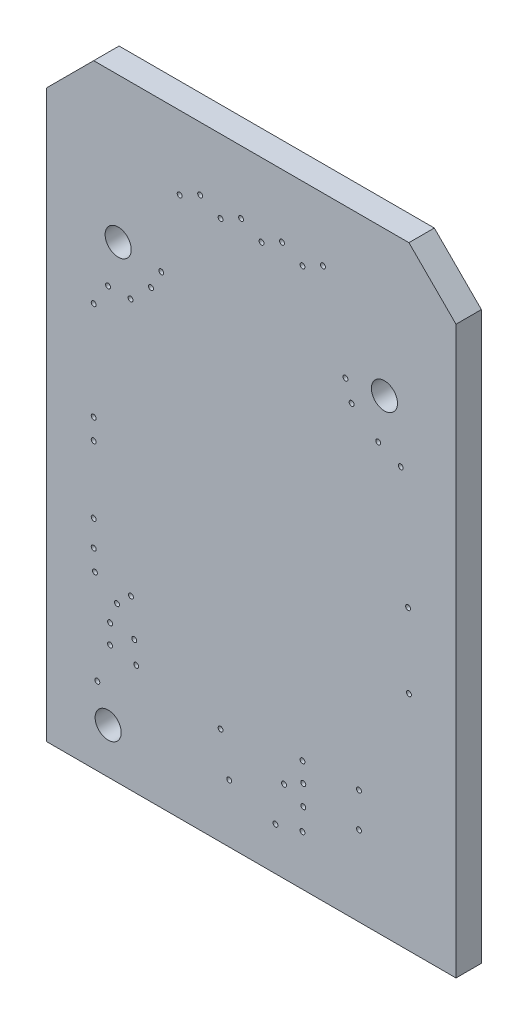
ISO-10303-21;
HEADER;
FILE_DESCRIPTION(('STEP AP214'),'2;1');
FILE_NAME('part.step','',(''),(''),'','','');
FILE_SCHEMA(('AUTOMOTIVE_DESIGN { 1 0 10303 214 1 1 1 1 }'));
ENDSEC;
DATA;
#1=APPLICATION_CONTEXT('core data for automotive mechanical design processes');
#2=APPLICATION_PROTOCOL_DEFINITION('international standard','automotive_design',2000,#1);
#3=PRODUCT_CONTEXT('',#1,'mechanical');
#4=PRODUCT('Part','Part','',(#3));
#5=PRODUCT_RELATED_PRODUCT_CATEGORY('part','',(#4));
#6=PRODUCT_DEFINITION_FORMATION('','',#4);
#7=PRODUCT_DEFINITION_CONTEXT('part definition',#1,'design');
#8=PRODUCT_DEFINITION('design','',#6,#7);
#9=PRODUCT_DEFINITION_SHAPE('','',#8);
#10=(LENGTH_UNIT() NAMED_UNIT(*) SI_UNIT(.MILLI.,.METRE.));
#11=(NAMED_UNIT(*) PLANE_ANGLE_UNIT() SI_UNIT($,.RADIAN.));
#12=(NAMED_UNIT(*) SI_UNIT($,.STERADIAN.) SOLID_ANGLE_UNIT());
#13=UNCERTAINTY_MEASURE_WITH_UNIT(LENGTH_MEASURE(1.E-05),#10,'distance_accuracy_value','');
#14=(GEOMETRIC_REPRESENTATION_CONTEXT(3) GLOBAL_UNCERTAINTY_ASSIGNED_CONTEXT((#13)) GLOBAL_UNIT_ASSIGNED_CONTEXT((#10,
#11,#12)) REPRESENTATION_CONTEXT('',''));
#15=CARTESIAN_POINT('',(0.,0.,0.));
#16=DIRECTION('',(0.,0.,1.));
#17=DIRECTION('',(1.,0.,0.));
#18=AXIS2_PLACEMENT_3D('',#15,#16,#17);
#19=CARTESIAN_POINT('',(0.,17.5641,0.7874));
#20=DIRECTION('',(1.,0.,0.));
#21=DIRECTION('',(0.,0.,-1.));
#22=AXIS2_PLACEMENT_3D('',#19,#20,#21);
#23=PLANE('',#22);
#24=DIRECTION('',(0.,-1.,0.));
#25=VECTOR('',#24,1.);
#26=CARTESIAN_POINT('',(0.,17.5641,0.));
#27=LINE('',#26,#25);
#28=CARTESIAN_POINT('',(0.,17.5641,0.));
#29=VERTEX_POINT('',#28);
#30=CARTESIAN_POINT('',(0.,0.,0.));
#31=VERTEX_POINT('',#30);
#32=EDGE_CURVE('E127',#29,#31,#27,.T.);
#33=ORIENTED_EDGE('',*,*,#32,.T.);
#34=DIRECTION('',(0.,0.,-1.));
#35=VECTOR('',#34,1.);
#36=CARTESIAN_POINT('',(0.,0.,0.7874));
#37=LINE('',#36,#35);
#38=CARTESIAN_POINT('',(0.,0.,0.7874));
#39=VERTEX_POINT('',#38);
#40=EDGE_CURVE('E11',#39,#31,#37,.T.);
#41=ORIENTED_EDGE('',*,*,#40,.F.);
#42=DIRECTION('',(0.,-1.,0.));
#43=VECTOR('',#42,1.);
#44=CARTESIAN_POINT('',(0.,17.5641,0.7874));
#45=LINE('',#44,#43);
#46=CARTESIAN_POINT('',(0.,17.5641,0.7874));
#47=VERTEX_POINT('',#46);
#48=EDGE_CURVE('E138',#47,#39,#45,.T.);
#49=ORIENTED_EDGE('',*,*,#48,.F.);
#50=DIRECTION('',(0.,0.,-1.));
#51=VECTOR('',#50,1.);
#52=CARTESIAN_POINT('',(0.,17.5641,0.7874));
#53=LINE('',#52,#51);
#54=EDGE_CURVE('E123',#47,#29,#53,.T.);
#55=ORIENTED_EDGE('',*,*,#54,.T.);
#56=EDGE_LOOP('',(#33,#41,#49,#55));
#57=FACE_BOUND('',#56,.T.);
#58=ADVANCED_FACE('F43',(#57),#23,.F.);
#59=CARTESIAN_POINT('',(0.,0.,0.7874));
#60=DIRECTION('',(0.,1.,0.));
#61=DIRECTION('',(0.,0.,1.));
#62=AXIS2_PLACEMENT_3D('',#59,#60,#61);
#63=PLANE('',#62);
#64=DIRECTION('',(1.,0.,0.));
#65=VECTOR('',#64,1.);
#66=CARTESIAN_POINT('',(0.,0.,0.));
#67=LINE('',#66,#65);
#68=CARTESIAN_POINT('',(12.7,0.,0.));
#69=VERTEX_POINT('',#68);
#70=EDGE_CURVE('E130',#31,#69,#67,.T.);
#71=ORIENTED_EDGE('',*,*,#70,.T.);
#72=DIRECTION('',(0.,0.,-1.));
#73=VECTOR('',#72,1.);
#74=CARTESIAN_POINT('',(12.7,0.,0.7874));
#75=LINE('',#74,#73);
#76=CARTESIAN_POINT('',(12.7,0.,0.7874));
#77=VERTEX_POINT('',#76);
#78=EDGE_CURVE('E51',#77,#69,#75,.T.);
#79=ORIENTED_EDGE('',*,*,#78,.F.);
#80=DIRECTION('',(1.,0.,0.));
#81=VECTOR('',#80,1.);
#82=CARTESIAN_POINT('',(0.,0.,0.7874));
#83=LINE('',#82,#81);
#84=EDGE_CURVE('E96',#39,#77,#83,.T.);
#85=ORIENTED_EDGE('',*,*,#84,.F.);
#86=ORIENTED_EDGE('',*,*,#40,.T.);
#87=EDGE_LOOP('',(#71,#79,#85,#86));
#88=FACE_BOUND('',#87,.T.);
#89=ADVANCED_FACE('F163',(#88),#63,.F.);
#90=CARTESIAN_POINT('',(12.7,0.,0.7874));
#91=DIRECTION('',(-1.,0.,0.));
#92=DIRECTION('',(0.,0.,1.));
#93=AXIS2_PLACEMENT_3D('',#90,#91,#92);
#94=PLANE('',#93);
#95=DIRECTION('',(0.,1.,0.));
#96=VECTOR('',#95,1.);
#97=CARTESIAN_POINT('',(12.7,0.,0.));
#98=LINE('',#97,#96);
#99=CARTESIAN_POINT('',(12.7,17.5641,0.));
#100=VERTEX_POINT('',#99);
#101=EDGE_CURVE('E133',#69,#100,#98,.T.);
#102=ORIENTED_EDGE('',*,*,#101,.T.);
#103=DIRECTION('',(0.,0.,-1.));
#104=VECTOR('',#103,1.);
#105=CARTESIAN_POINT('',(12.7,17.5641,0.7874));
#106=LINE('',#105,#104);
#107=CARTESIAN_POINT('',(12.7,17.5641,0.7874));
#108=VERTEX_POINT('',#107);
#109=EDGE_CURVE('E118',#108,#100,#106,.T.);
#110=ORIENTED_EDGE('',*,*,#109,.F.);
#111=DIRECTION('',(0.,1.,0.));
#112=VECTOR('',#111,1.);
#113=CARTESIAN_POINT('',(12.7,0.,0.7874));
#114=LINE('',#113,#112);
#115=EDGE_CURVE('E109',#77,#108,#114,.T.);
#116=ORIENTED_EDGE('',*,*,#115,.F.);
#117=ORIENTED_EDGE('',*,*,#78,.T.);
#118=EDGE_LOOP('',(#102,#110,#116,#117));
#119=FACE_BOUND('',#118,.T.);
#120=ADVANCED_FACE('F144',(#119),#94,.F.);
#121=CARTESIAN_POINT('',(12.7,17.5641,0.7874));
#122=DIRECTION('',(-0.707106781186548,-0.707106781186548,0.));
#123=DIRECTION('',(0.707106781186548,-0.707106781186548,0.));
#124=AXIS2_PLACEMENT_3D('',#121,#122,#123);
#125=PLANE('',#124);
#126=DIRECTION('',(-0.707106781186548,0.707106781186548,0.));
#127=VECTOR('',#126,1.);
#128=CARTESIAN_POINT('',(12.7,17.5641,0.));
#129=LINE('',#128,#127);
#130=CARTESIAN_POINT('',(11.2395,19.0246,0.));
#131=VERTEX_POINT('',#130);
#132=EDGE_CURVE('E117',#100,#131,#129,.T.);
#133=ORIENTED_EDGE('',*,*,#132,.T.);
#134=DIRECTION('',(0.,0.,-1.));
#135=VECTOR('',#134,1.);
#136=CARTESIAN_POINT('',(11.2395,19.0246,0.7874));
#137=LINE('',#136,#135);
#138=CARTESIAN_POINT('',(11.2395,19.0246,0.7874));
#139=VERTEX_POINT('',#138);
#140=EDGE_CURVE('E114',#139,#131,#137,.T.);
#141=ORIENTED_EDGE('',*,*,#140,.F.);
#142=DIRECTION('',(-0.707106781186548,0.707106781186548,0.));
#143=VECTOR('',#142,1.);
#144=CARTESIAN_POINT('',(12.7,17.5641,0.7874));
#145=LINE('',#144,#143);
#146=EDGE_CURVE('E103',#108,#139,#145,.T.);
#147=ORIENTED_EDGE('',*,*,#146,.F.);
#148=ORIENTED_EDGE('',*,*,#109,.T.);
#149=EDGE_LOOP('',(#133,#141,#147,#148));
#150=FACE_BOUND('',#149,.T.);
#151=ADVANCED_FACE('F115',(#150),#125,.F.);
#152=CARTESIAN_POINT('',(11.2395,19.0246,0.7874));
#153=DIRECTION('',(0.,-1.,0.));
#154=DIRECTION('',(0.,0.,-1.));
#155=AXIS2_PLACEMENT_3D('',#152,#153,#154);
#156=PLANE('',#155);
#157=DIRECTION('',(-1.,0.,0.));
#158=VECTOR('',#157,1.);
#159=CARTESIAN_POINT('',(11.2395,19.0246,0.));
#160=LINE('',#159,#158);
#161=CARTESIAN_POINT('',(1.4605,19.0246,0.));
#162=VERTEX_POINT('',#161);
#163=EDGE_CURVE('E82',#131,#162,#160,.T.);
#164=ORIENTED_EDGE('',*,*,#163,.T.);
#165=DIRECTION('',(0.,0.,-1.));
#166=VECTOR('',#165,1.);
#167=CARTESIAN_POINT('',(1.4605,19.0246,0.7874));
#168=LINE('',#167,#166);
#169=CARTESIAN_POINT('',(1.4605,19.0246,0.7874));
#170=VERTEX_POINT('',#169);
#171=EDGE_CURVE('E119',#170,#162,#168,.T.);
#172=ORIENTED_EDGE('',*,*,#171,.F.);
#173=DIRECTION('',(-1.,0.,0.));
#174=VECTOR('',#173,1.);
#175=CARTESIAN_POINT('',(11.2395,19.0246,0.7874));
#176=LINE('',#175,#174);
#177=EDGE_CURVE('E107',#139,#170,#176,.T.);
#178=ORIENTED_EDGE('',*,*,#177,.F.);
#179=ORIENTED_EDGE('',*,*,#140,.T.);
#180=EDGE_LOOP('',(#164,#172,#178,#179));
#181=FACE_BOUND('',#180,.T.);
#182=ADVANCED_FACE('F121',(#181),#156,.F.);
#183=CARTESIAN_POINT('',(1.4605,19.0246,0.7874));
#184=DIRECTION('',(0.707106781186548,-0.707106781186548,0.));
#185=DIRECTION('',(0.707106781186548,0.707106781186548,0.));
#186=AXIS2_PLACEMENT_3D('',#183,#184,#185);
#187=PLANE('',#186);
#188=DIRECTION('',(-0.707106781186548,-0.707106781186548,0.));
#189=VECTOR('',#188,1.);
#190=CARTESIAN_POINT('',(1.4605,19.0246,0.));
#191=LINE('',#190,#189);
#192=EDGE_CURVE('E88',#162,#29,#191,.T.);
#193=ORIENTED_EDGE('',*,*,#192,.T.);
#194=ORIENTED_EDGE('',*,*,#54,.F.);
#195=DIRECTION('',(-0.707106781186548,-0.707106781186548,0.));
#196=VECTOR('',#195,1.);
#197=CARTESIAN_POINT('',(1.4605,19.0246,0.7874));
#198=LINE('',#197,#196);
#199=EDGE_CURVE('E59',#170,#47,#198,.T.);
#200=ORIENTED_EDGE('',*,*,#199,.F.);
#201=ORIENTED_EDGE('',*,*,#171,.T.);
#202=EDGE_LOOP('',(#193,#194,#200,#201));
#203=FACE_BOUND('',#202,.T.);
#204=ADVANCED_FACE('F151',(#203),#187,.F.);
#205=CARTESIAN_POINT('',(0.,0.,0.7874));
#206=DIRECTION('',(0.,0.,1.));
#207=DIRECTION('',(1.,0.,0.));
#208=AXIS2_PLACEMENT_3D('',#205,#206,#207);
#209=PLANE('',#208);
#210=CARTESIAN_POINT('',(1.91,1.4,0.7874));
#211=DIRECTION('',(0.,0.,1.));
#212=DIRECTION('',(1.,0.,0.));
#213=AXIS2_PLACEMENT_3D('',#210,#211,#212);
#214=CIRCLE('',#213,0.405);
#215=CARTESIAN_POINT('',(2.315,1.4,0.7874));
#216=VERTEX_POINT('',#215);
#217=EDGE_CURVE('E713',#216,#216,#214,.T.);
#218=ORIENTED_EDGE('',*,*,#217,.F.);
#219=EDGE_LOOP('',(#218));
#220=FACE_BOUND('',#219,.T.);
#221=CARTESIAN_POINT('',(10.48,14.53,0.7874));
#222=DIRECTION('',(0.,0.,1.));
#223=DIRECTION('',(1.,0.,0.));
#224=AXIS2_PLACEMENT_3D('',#221,#222,#223);
#225=CIRCLE('',#224,0.405000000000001);
#226=CARTESIAN_POINT('',(10.885,14.53,0.7874));
#227=VERTEX_POINT('',#226);
#228=EDGE_CURVE('E729',#227,#227,#225,.T.);
#229=ORIENTED_EDGE('',*,*,#228,.F.);
#230=EDGE_LOOP('',(#229));
#231=FACE_BOUND('',#230,.T.);
#232=CARTESIAN_POINT('',(2.22,14.53,0.7874));
#233=DIRECTION('',(0.,0.,1.));
#234=DIRECTION('',(1.,0.,0.));
#235=AXIS2_PLACEMENT_3D('',#232,#233,#234);
#236=CIRCLE('',#235,0.405);
#237=CARTESIAN_POINT('',(2.625,14.53,0.7874));
#238=VERTEX_POINT('',#237);
#239=EDGE_CURVE('E722',#238,#238,#236,.T.);
#240=ORIENTED_EDGE('',*,*,#239,.F.);
#241=EDGE_LOOP('',(#240));
#242=FACE_BOUND('',#241,.T.);
#243=CARTESIAN_POINT('',(7.9375,3.4544,0.7874));
#244=DIRECTION('',(0.,0.,1.));
#245=DIRECTION('',(1.,0.,0.));
#246=AXIS2_PLACEMENT_3D('',#243,#244,#245);
#247=CIRCLE('',#246,0.0762000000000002);
#248=CARTESIAN_POINT('',(8.0137,3.4544,0.7874));
#249=VERTEX_POINT('',#248);
#250=EDGE_CURVE('E845',#249,#249,#247,.T.);
#251=ORIENTED_EDGE('',*,*,#250,.F.);
#252=EDGE_LOOP('',(#251));
#253=FACE_BOUND('',#252,.T.);
#254=CARTESIAN_POINT('',(10.9855,12.8778,0.7874));
#255=DIRECTION('',(0.,0.,1.));
#256=DIRECTION('',(1.,0.,0.));
#257=AXIS2_PLACEMENT_3D('',#254,#255,#256);
#258=CIRCLE('',#257,0.0762000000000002);
#259=CARTESIAN_POINT('',(11.0617,12.8778,0.7874));
#260=VERTEX_POINT('',#259);
#261=EDGE_CURVE('E839',#260,#260,#258,.T.);
#262=ORIENTED_EDGE('',*,*,#261,.F.);
#263=EDGE_LOOP('',(#262));
#264=FACE_BOUND('',#263,.T.);
#265=CARTESIAN_POINT('',(6.6675,16.7513,0.7874));
#266=DIRECTION('',(0.,0.,1.));
#267=DIRECTION('',(1.,0.,0.));
#268=AXIS2_PLACEMENT_3D('',#265,#266,#267);
#269=CIRCLE('',#268,0.0762000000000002);
#270=CARTESIAN_POINT('',(6.7437,16.7513,0.7874));
#271=VERTEX_POINT('',#270);
#272=EDGE_CURVE('E833',#271,#271,#269,.T.);
#273=ORIENTED_EDGE('',*,*,#272,.F.);
#274=EDGE_LOOP('',(#273));
#275=FACE_BOUND('',#274,.T.);
#276=CARTESIAN_POINT('',(10.287,13.1953,0.7874));
#277=DIRECTION('',(0.,0.,1.));
#278=DIRECTION('',(1.,0.,0.));
#279=AXIS2_PLACEMENT_3D('',#276,#277,#278);
#280=CIRCLE('',#279,0.0762000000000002);
#281=CARTESIAN_POINT('',(10.3632,13.1953,0.7874));
#282=VERTEX_POINT('',#281);
#283=EDGE_CURVE('E826',#282,#282,#280,.T.);
#284=ORIENTED_EDGE('',*,*,#283,.F.);
#285=EDGE_LOOP('',(#284));
#286=FACE_BOUND('',#285,.T.);
#287=CARTESIAN_POINT('',(9.271,14.4018,0.7874));
#288=DIRECTION('',(0.,0.,1.));
#289=DIRECTION('',(1.,0.,0.));
#290=AXIS2_PLACEMENT_3D('',#287,#288,#289);
#291=CIRCLE('',#290,0.0762000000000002);
#292=CARTESIAN_POINT('',(9.3472,14.4018,0.7874));
#293=VERTEX_POINT('',#292);
#294=EDGE_CURVE('E862',#293,#293,#291,.T.);
#295=ORIENTED_EDGE('',*,*,#294,.F.);
#296=EDGE_LOOP('',(#295));
#297=FACE_BOUND('',#296,.T.);
#298=CARTESIAN_POINT('',(7.9375,16.7513,0.7874));
#299=DIRECTION('',(0.,0.,1.));
#300=DIRECTION('',(1.,0.,0.));
#301=AXIS2_PLACEMENT_3D('',#298,#299,#300);
#302=CIRCLE('',#301,0.0762000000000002);
#303=CARTESIAN_POINT('',(8.0137,16.7513,0.7874));
#304=VERTEX_POINT('',#303);
#305=EDGE_CURVE('E869',#304,#304,#302,.T.);
#306=ORIENTED_EDGE('',*,*,#305,.F.);
#307=EDGE_LOOP('',(#306));
#308=FACE_BOUND('',#307,.T.);
#309=CARTESIAN_POINT('',(9.4615,13.8176,0.7874));
#310=DIRECTION('',(0.,0.,1.));
#311=DIRECTION('',(1.,0.,0.));
#312=AXIS2_PLACEMENT_3D('',#309,#310,#311);
#313=CIRCLE('',#312,0.0762000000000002);
#314=CARTESIAN_POINT('',(9.5377,13.8176,0.7874));
#315=VERTEX_POINT('',#314);
#316=EDGE_CURVE('E850',#315,#315,#313,.T.);
#317=ORIENTED_EDGE('',*,*,#316,.F.);
#318=EDGE_LOOP('',(#317));
#319=FACE_BOUND('',#318,.T.);
#320=CARTESIAN_POINT('',(7.3025,17.0688,0.7874));
#321=DIRECTION('',(0.,0.,1.));
#322=DIRECTION('',(1.,0.,0.));
#323=AXIS2_PLACEMENT_3D('',#320,#321,#322);
#324=CIRCLE('',#323,0.0762000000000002);
#325=CARTESIAN_POINT('',(7.3787,17.0688,0.7874));
#326=VERTEX_POINT('',#325);
#327=EDGE_CURVE('E857',#326,#326,#324,.T.);
#328=ORIENTED_EDGE('',*,*,#327,.F.);
#329=EDGE_LOOP('',(#328));
#330=FACE_BOUND('',#329,.T.);
#331=CARTESIAN_POINT('',(7.0993,1.3335,0.7874));
#332=DIRECTION('',(0.,0.,1.));
#333=DIRECTION('',(1.,0.,0.));
#334=AXIS2_PLACEMENT_3D('',#331,#332,#333);
#335=CIRCLE('',#334,0.0762000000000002);
#336=CARTESIAN_POINT('',(7.1755,1.3335,0.7874));
#337=VERTEX_POINT('',#336);
#338=EDGE_CURVE('E797',#337,#337,#335,.T.);
#339=ORIENTED_EDGE('',*,*,#338,.F.);
#340=EDGE_LOOP('',(#339));
#341=FACE_BOUND('',#340,.T.);
#342=CARTESIAN_POINT('',(7.9375,1.5494,0.7874));
#343=DIRECTION('',(0.,0.,1.));
#344=DIRECTION('',(1.,0.,0.));
#345=AXIS2_PLACEMENT_3D('',#342,#343,#344);
#346=CIRCLE('',#345,0.0762000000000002);
#347=CARTESIAN_POINT('',(8.0137,1.5494,0.7874));
#348=VERTEX_POINT('',#347);
#349=EDGE_CURVE('E791',#348,#348,#346,.T.);
#350=ORIENTED_EDGE('',*,*,#349,.F.);
#351=EDGE_LOOP('',(#350));
#352=FACE_BOUND('',#351,.T.);
#353=CARTESIAN_POINT('',(5.6642,1.8034,0.7874));
#354=DIRECTION('',(0.,0.,1.));
#355=DIRECTION('',(1.,0.,0.));
#356=AXIS2_PLACEMENT_3D('',#353,#354,#355);
#357=CIRCLE('',#356,0.0762000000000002);
#358=CARTESIAN_POINT('',(5.7404,1.8034,0.7874));
#359=VERTEX_POINT('',#358);
#360=EDGE_CURVE('E785',#359,#359,#357,.T.);
#361=ORIENTED_EDGE('',*,*,#360,.F.);
#362=EDGE_LOOP('',(#361));
#363=FACE_BOUND('',#362,.T.);
#364=CARTESIAN_POINT('',(2.6162,5.2197,0.7874));
#365=DIRECTION('',(0.,0.,1.));
#366=DIRECTION('',(1.,0.,0.));
#367=AXIS2_PLACEMENT_3D('',#364,#365,#366);
#368=CIRCLE('',#367,0.0762000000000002);
#369=CARTESIAN_POINT('',(2.6924,5.2197,0.7874));
#370=VERTEX_POINT('',#369);
#371=EDGE_CURVE('E778',#370,#370,#368,.T.);
#372=ORIENTED_EDGE('',*,*,#371,.F.);
#373=EDGE_LOOP('',(#372));
#374=FACE_BOUND('',#373,.T.);
#375=CARTESIAN_POINT('',(7.9629,2.2352,0.7874));
#376=DIRECTION('',(0.,0.,1.));
#377=DIRECTION('',(1.,0.,0.));
#378=AXIS2_PLACEMENT_3D('',#375,#376,#377);
#379=CIRCLE('',#378,0.0762000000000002);
#380=CARTESIAN_POINT('',(8.0391,2.2352,0.7874));
#381=VERTEX_POINT('',#380);
#382=EDGE_CURVE('E821',#381,#381,#379,.T.);
#383=ORIENTED_EDGE('',*,*,#382,.F.);
#384=EDGE_LOOP('',(#383));
#385=FACE_BOUND('',#384,.T.);
#386=CARTESIAN_POINT('',(1.5748,2.413,0.7874));
#387=DIRECTION('',(0.,0.,1.));
#388=DIRECTION('',(1.,0.,0.));
#389=AXIS2_PLACEMENT_3D('',#386,#387,#388);
#390=CIRCLE('',#389,0.0762);
#391=CARTESIAN_POINT('',(1.651,2.413,0.7874));
#392=VERTEX_POINT('',#391);
#393=EDGE_CURVE('E815',#392,#392,#390,.T.);
#394=ORIENTED_EDGE('',*,*,#393,.F.);
#395=EDGE_LOOP('',(#394));
#396=FACE_BOUND('',#395,.T.);
#397=CARTESIAN_POINT('',(5.3975,3.0353,0.7874));
#398=DIRECTION('',(0.,0.,1.));
#399=DIRECTION('',(1.,0.,0.));
#400=AXIS2_PLACEMENT_3D('',#397,#398,#399);
#401=CIRCLE('',#400,0.0762000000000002);
#402=CARTESIAN_POINT('',(5.4737,3.0353,0.7874));
#403=VERTEX_POINT('',#402);
#404=EDGE_CURVE('E809',#403,#403,#401,.T.);
#405=ORIENTED_EDGE('',*,*,#404,.F.);
#406=EDGE_LOOP('',(#405));
#407=FACE_BOUND('',#406,.T.);
#408=CARTESIAN_POINT('',(2.7813,3.4417,0.7874));
#409=DIRECTION('',(0.,0.,1.));
#410=DIRECTION('',(1.,0.,0.));
#411=AXIS2_PLACEMENT_3D('',#408,#409,#410);
#412=CIRCLE('',#411,0.0761999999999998);
#413=CARTESIAN_POINT('',(2.8575,3.4417,0.7874));
#414=VERTEX_POINT('',#413);
#415=EDGE_CURVE('E802',#414,#414,#412,.T.);
#416=ORIENTED_EDGE('',*,*,#415,.F.);
#417=EDGE_LOOP('',(#416));
#418=FACE_BOUND('',#417,.T.);
#419=CARTESIAN_POINT('',(1.4605,8.8138,0.7874));
#420=DIRECTION('',(0.,0.,1.));
#421=DIRECTION('',(1.,0.,0.));
#422=AXIS2_PLACEMENT_3D('',#419,#420,#421);
#423=CIRCLE('',#422,0.0762);
#424=CARTESIAN_POINT('',(1.5367,8.8138,0.7874));
#425=VERTEX_POINT('',#424);
#426=EDGE_CURVE('E936',#425,#425,#423,.T.);
#427=ORIENTED_EDGE('',*,*,#426,.F.);
#428=EDGE_LOOP('',(#427));
#429=FACE_BOUND('',#428,.T.);
#430=CARTESIAN_POINT('',(6.0325,17.0688,0.7874));
#431=DIRECTION('',(0.,0.,1.));
#432=DIRECTION('',(1.,0.,0.));
#433=AXIS2_PLACEMENT_3D('',#430,#431,#432);
#434=CIRCLE('',#433,0.0762000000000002);
#435=CARTESIAN_POINT('',(6.1087,17.0688,0.7874));
#436=VERTEX_POINT('',#435);
#437=EDGE_CURVE('E943',#436,#436,#434,.T.);
#438=ORIENTED_EDGE('',*,*,#437,.F.);
#439=EDGE_LOOP('',(#438));
#440=FACE_BOUND('',#439,.T.);
#441=CARTESIAN_POINT('',(1.905,13.1953,0.7874));
#442=DIRECTION('',(0.,0.,1.));
#443=DIRECTION('',(1.,0.,0.));
#444=AXIS2_PLACEMENT_3D('',#441,#442,#443);
#445=CIRCLE('',#444,0.0761999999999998);
#446=CARTESIAN_POINT('',(1.9812,13.1953,0.7874));
#447=VERTEX_POINT('',#446);
#448=EDGE_CURVE('E923',#447,#447,#445,.T.);
#449=ORIENTED_EDGE('',*,*,#448,.F.);
#450=EDGE_LOOP('',(#449));
#451=FACE_BOUND('',#450,.T.);
#452=CARTESIAN_POINT('',(5.3975,16.7513,0.7874));
#453=DIRECTION('',(0.,0.,1.));
#454=DIRECTION('',(1.,0.,0.));
#455=AXIS2_PLACEMENT_3D('',#452,#453,#454);
#456=CIRCLE('',#455,0.0762000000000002);
#457=CARTESIAN_POINT('',(5.4737,16.7513,0.7874));
#458=VERTEX_POINT('',#457);
#459=EDGE_CURVE('E930',#458,#458,#456,.T.);
#460=ORIENTED_EDGE('',*,*,#459,.F.);
#461=EDGE_LOOP('',(#460));
#462=FACE_BOUND('',#461,.T.);
#463=CARTESIAN_POINT('',(1.4605,12.4968,0.7874));
#464=DIRECTION('',(0.,0.,1.));
#465=DIRECTION('',(1.,0.,0.));
#466=AXIS2_PLACEMENT_3D('',#463,#464,#465);
#467=CIRCLE('',#466,0.0762);
#468=CARTESIAN_POINT('',(1.5367,12.4968,0.7874));
#469=VERTEX_POINT('',#468);
#470=EDGE_CURVE('E967',#469,#469,#467,.T.);
#471=ORIENTED_EDGE('',*,*,#470,.F.);
#472=EDGE_LOOP('',(#471));
#473=FACE_BOUND('',#472,.T.);
#474=CARTESIAN_POINT('',(11.2141,9.2075,0.7874));
#475=DIRECTION('',(0.,0.,1.));
#476=DIRECTION('',(1.,0.,0.));
#477=AXIS2_PLACEMENT_3D('',#474,#475,#476);
#478=CIRCLE('',#477,0.0762000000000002);
#479=CARTESIAN_POINT('',(11.2903,9.2075,0.7874));
#480=VERTEX_POINT('',#479);
#481=EDGE_CURVE('E961',#480,#480,#478,.T.);
#482=ORIENTED_EDGE('',*,*,#481,.F.);
#483=EDGE_LOOP('',(#482));
#484=FACE_BOUND('',#483,.T.);
#485=CARTESIAN_POINT('',(1.4986,5.3086,0.7874));
#486=DIRECTION('',(0.,0.,1.));
#487=DIRECTION('',(1.,0.,0.));
#488=AXIS2_PLACEMENT_3D('',#485,#486,#487);
#489=CIRCLE('',#488,0.0762);
#490=CARTESIAN_POINT('',(1.5748,5.3086,0.7874));
#491=VERTEX_POINT('',#490);
#492=EDGE_CURVE('E955',#491,#491,#489,.T.);
#493=ORIENTED_EDGE('',*,*,#492,.F.);
#494=EDGE_LOOP('',(#493));
#495=FACE_BOUND('',#494,.T.);
#496=CARTESIAN_POINT('',(9.6901,2.4765,0.7874));
#497=DIRECTION('',(0.,0.,1.));
#498=DIRECTION('',(1.,0.,0.));
#499=AXIS2_PLACEMENT_3D('',#496,#497,#498);
#500=CIRCLE('',#499,0.0762000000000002);
#501=CARTESIAN_POINT('',(9.7663,2.4765,0.7874));
#502=VERTEX_POINT('',#501);
#503=EDGE_CURVE('E948',#502,#502,#500,.T.);
#504=ORIENTED_EDGE('',*,*,#503,.F.);
#505=EDGE_LOOP('',(#504));
#506=FACE_BOUND('',#505,.T.);
#507=CARTESIAN_POINT('',(3.556,14.4018,0.7874));
#508=DIRECTION('',(0.,0.,1.));
#509=DIRECTION('',(1.,0.,0.));
#510=AXIS2_PLACEMENT_3D('',#507,#508,#509);
#511=CIRCLE('',#510,0.0762000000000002);
#512=CARTESIAN_POINT('',(3.6322,14.4018,0.7874));
#513=VERTEX_POINT('',#512);
#514=EDGE_CURVE('E887',#513,#513,#511,.T.);
#515=ORIENTED_EDGE('',*,*,#514,.F.);
#516=EDGE_LOOP('',(#515));
#517=FACE_BOUND('',#516,.T.);
#518=CARTESIAN_POINT('',(7.9629,2.8575,0.7874));
#519=DIRECTION('',(0.,0.,1.));
#520=DIRECTION('',(1.,0.,0.));
#521=AXIS2_PLACEMENT_3D('',#518,#519,#520);
#522=CIRCLE('',#521,0.0762000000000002);
#523=CARTESIAN_POINT('',(8.0391,2.8575,0.7874));
#524=VERTEX_POINT('',#523);
#525=EDGE_CURVE('E894',#524,#524,#522,.T.);
#526=ORIENTED_EDGE('',*,*,#525,.F.);
#527=EDGE_LOOP('',(#526));
#528=FACE_BOUND('',#527,.T.);
#529=CARTESIAN_POINT('',(2.1844,4.8006,0.7874));
#530=DIRECTION('',(0.,0.,1.));
#531=DIRECTION('',(1.,0.,0.));
#532=AXIS2_PLACEMENT_3D('',#529,#530,#531);
#533=CIRCLE('',#532,0.0761999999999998);
#534=CARTESIAN_POINT('',(2.2606,4.8006,0.7874));
#535=VERTEX_POINT('',#534);
#536=EDGE_CURVE('E874',#535,#535,#533,.T.);
#537=ORIENTED_EDGE('',*,*,#536,.F.);
#538=EDGE_LOOP('',(#537));
#539=FACE_BOUND('',#538,.T.);
#540=CARTESIAN_POINT('',(8.5725,17.0688,0.7874));
#541=DIRECTION('',(0.,0.,1.));
#542=DIRECTION('',(1.,0.,0.));
#543=AXIS2_PLACEMENT_3D('',#540,#541,#542);
#544=CIRCLE('',#543,0.0762000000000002);
#545=CARTESIAN_POINT('',(8.6487,17.0688,0.7874));
#546=VERTEX_POINT('',#545);
#547=EDGE_CURVE('E881',#546,#546,#544,.T.);
#548=ORIENTED_EDGE('',*,*,#547,.F.);
#549=EDGE_LOOP('',(#548));
#550=FACE_BOUND('',#549,.T.);
#551=CARTESIAN_POINT('',(2.6035,13.1953,0.7874));
#552=DIRECTION('',(0.,0.,1.));
#553=DIRECTION('',(1.,0.,0.));
#554=AXIS2_PLACEMENT_3D('',#551,#552,#553);
#555=CIRCLE('',#554,0.0762000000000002);
#556=CARTESIAN_POINT('',(2.6797,13.1953,0.7874));
#557=VERTEX_POINT('',#556);
#558=EDGE_CURVE('E911',#557,#557,#555,.T.);
#559=ORIENTED_EDGE('',*,*,#558,.F.);
#560=EDGE_LOOP('',(#559));
#561=FACE_BOUND('',#560,.T.);
#562=CARTESIAN_POINT('',(4.7625,17.0688,0.7874));
#563=DIRECTION('',(0.,0.,1.));
#564=DIRECTION('',(1.,0.,0.));
#565=AXIS2_PLACEMENT_3D('',#562,#563,#564);
#566=CIRCLE('',#565,0.0762000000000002);
#567=CARTESIAN_POINT('',(4.8387,17.0688,0.7874));
#568=VERTEX_POINT('',#567);
#569=EDGE_CURVE('E918',#568,#568,#566,.T.);
#570=ORIENTED_EDGE('',*,*,#569,.F.);
#571=EDGE_LOOP('',(#570));
#572=FACE_BOUND('',#571,.T.);
#573=CARTESIAN_POINT('',(3.2385,13.8176,0.7874));
#574=DIRECTION('',(0.,0.,1.));
#575=DIRECTION('',(1.,0.,0.));
#576=AXIS2_PLACEMENT_3D('',#573,#574,#575);
#577=CIRCLE('',#576,0.0762000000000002);
#578=CARTESIAN_POINT('',(3.3147,13.8176,0.7874));
#579=VERTEX_POINT('',#578);
#580=EDGE_CURVE('E899',#579,#579,#577,.T.);
#581=ORIENTED_EDGE('',*,*,#580,.F.);
#582=EDGE_LOOP('',(#581));
#583=FACE_BOUND('',#582,.T.);
#584=CARTESIAN_POINT('',(4.1275,16.7513,0.7874));
#585=DIRECTION('',(0.,0.,1.));
#586=DIRECTION('',(1.,0.,0.));
#587=AXIS2_PLACEMENT_3D('',#584,#585,#586);
#588=CIRCLE('',#587,0.0762000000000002);
#589=CARTESIAN_POINT('',(4.2037,16.7513,0.7874));
#590=VERTEX_POINT('',#589);
#591=EDGE_CURVE('E906',#590,#590,#588,.T.);
#592=ORIENTED_EDGE('',*,*,#591,.F.);
#593=EDGE_LOOP('',(#592));
#594=FACE_BOUND('',#593,.T.);
#595=CARTESIAN_POINT('',(9.6901,3.5433,0.7874));
#596=DIRECTION('',(0.,0.,1.));
#597=DIRECTION('',(1.,0.,0.));
#598=AXIS2_PLACEMENT_3D('',#595,#596,#597);
#599=CIRCLE('',#598,0.0762000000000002);
#600=CARTESIAN_POINT('',(9.7663,3.5433,0.7874));
#601=VERTEX_POINT('',#600);
#602=EDGE_CURVE('E742',#601,#601,#599,.T.);
#603=ORIENTED_EDGE('',*,*,#602,.F.);
#604=EDGE_LOOP('',(#603));
#605=FACE_BOUND('',#604,.T.);
#606=CARTESIAN_POINT('',(1.4605,5.9309,0.7874));
#607=DIRECTION('',(0.,0.,1.));
#608=DIRECTION('',(1.,0.,0.));
#609=AXIS2_PLACEMENT_3D('',#606,#607,#608);
#610=CIRCLE('',#609,0.0762);
#611=CARTESIAN_POINT('',(1.5367,5.9309,0.7874));
#612=VERTEX_POINT('',#611);
#613=EDGE_CURVE('E749',#612,#612,#610,.T.);
#614=ORIENTED_EDGE('',*,*,#613,.F.);
#615=EDGE_LOOP('',(#614));
#616=FACE_BOUND('',#615,.T.);
#617=CARTESIAN_POINT('',(1.9685,4.1783,0.7874));
#618=DIRECTION('',(0.,0.,1.));
#619=DIRECTION('',(1.,0.,0.));
#620=AXIS2_PLACEMENT_3D('',#617,#618,#619);
#621=CIRCLE('',#620,0.0762000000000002);
#622=CARTESIAN_POINT('',(2.0447,4.1783,0.7874));
#623=VERTEX_POINT('',#622);
#624=EDGE_CURVE('E730',#623,#623,#621,.T.);
#625=ORIENTED_EDGE('',*,*,#624,.F.);
#626=EDGE_LOOP('',(#625));
#627=FACE_BOUND('',#626,.T.);
#628=CARTESIAN_POINT('',(2.7178,4.1021,0.7874));
#629=DIRECTION('',(0.,0.,1.));
#630=DIRECTION('',(1.,0.,0.));
#631=AXIS2_PLACEMENT_3D('',#628,#629,#630);
#632=CIRCLE('',#631,0.0761999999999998);
#633=CARTESIAN_POINT('',(2.794,4.1021,0.7874));
#634=VERTEX_POINT('',#633);
#635=EDGE_CURVE('E737',#634,#634,#632,.T.);
#636=ORIENTED_EDGE('',*,*,#635,.F.);
#637=EDGE_LOOP('',(#636));
#638=FACE_BOUND('',#637,.T.);
#639=CARTESIAN_POINT('',(7.366,2.54,0.7874));
#640=DIRECTION('',(0.,0.,1.));
#641=DIRECTION('',(1.,0.,0.));
#642=AXIS2_PLACEMENT_3D('',#639,#640,#641);
#643=CIRCLE('',#642,0.0762000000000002);
#644=CARTESIAN_POINT('',(7.4422,2.54,0.7874));
#645=VERTEX_POINT('',#644);
#646=EDGE_CURVE('E766',#645,#645,#643,.T.);
#647=ORIENTED_EDGE('',*,*,#646,.F.);
#648=EDGE_LOOP('',(#647));
#649=FACE_BOUND('',#648,.T.);
#650=CARTESIAN_POINT('',(1.4605,6.731,0.7874));
#651=DIRECTION('',(0.,0.,1.));
#652=DIRECTION('',(1.,0.,0.));
#653=AXIS2_PLACEMENT_3D('',#650,#651,#652);
#654=CIRCLE('',#653,0.0762);
#655=CARTESIAN_POINT('',(1.5367,6.731,0.7874));
#656=VERTEX_POINT('',#655);
#657=EDGE_CURVE('E773',#656,#656,#654,.T.);
#658=ORIENTED_EDGE('',*,*,#657,.F.);
#659=EDGE_LOOP('',(#658));
#660=FACE_BOUND('',#659,.T.);
#661=CARTESIAN_POINT('',(11.2395,6.9088,0.7874));
#662=DIRECTION('',(0.,0.,1.));
#663=DIRECTION('',(1.,0.,0.));
#664=AXIS2_PLACEMENT_3D('',#661,#662,#663);
#665=CIRCLE('',#664,0.0762000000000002);
#666=CARTESIAN_POINT('',(11.3157,6.9088,0.7874));
#667=VERTEX_POINT('',#666);
#668=EDGE_CURVE('E754',#667,#667,#665,.T.);
#669=ORIENTED_EDGE('',*,*,#668,.F.);
#670=EDGE_LOOP('',(#669));
#671=FACE_BOUND('',#670,.T.);
#672=CARTESIAN_POINT('',(1.9685,3.5814,0.7874));
#673=DIRECTION('',(0.,0.,1.));
#674=DIRECTION('',(1.,0.,0.));
#675=AXIS2_PLACEMENT_3D('',#672,#673,#674);
#676=CIRCLE('',#675,0.0762000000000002);
#677=CARTESIAN_POINT('',(2.0447,3.5814,0.7874));
#678=VERTEX_POINT('',#677);
#679=EDGE_CURVE('E761',#678,#678,#676,.T.);
#680=ORIENTED_EDGE('',*,*,#679,.F.);
#681=EDGE_LOOP('',(#680));
#682=FACE_BOUND('',#681,.T.);
#683=CARTESIAN_POINT('',(1.4605,9.4488,0.7874));
#684=DIRECTION('',(0.,0.,1.));
#685=DIRECTION('',(1.,0.,0.));
#686=AXIS2_PLACEMENT_3D('',#683,#684,#685);
#687=CIRCLE('',#686,0.0762);
#688=CARTESIAN_POINT('',(1.5367,9.4488,0.7874));
#689=VERTEX_POINT('',#688);
#690=EDGE_CURVE('E131',#689,#689,#687,.T.);
#691=ORIENTED_EDGE('',*,*,#690,.F.);
#692=EDGE_LOOP('',(#691));
#693=FACE_BOUND('',#692,.T.);
#694=ORIENTED_EDGE('',*,*,#48,.T.);
#695=ORIENTED_EDGE('',*,*,#84,.T.);
#696=ORIENTED_EDGE('',*,*,#115,.T.);
#697=ORIENTED_EDGE('',*,*,#146,.T.);
#698=ORIENTED_EDGE('',*,*,#177,.T.);
#699=ORIENTED_EDGE('',*,*,#199,.T.);
#700=EDGE_LOOP('',(#694,#695,#696,#697,#698,#699));
#701=FACE_BOUND('',#700,.T.);
#702=ADVANCED_FACE('F105',(#220,#231,#242,#253,#264,#275,#286,#297,#308,#319,#330,#341,#352,
#363,#374,#385,#396,#407,#418,#429,#440,#451,#462,#473,#484,#495,#506,#517,#528,#539,#550,#561,
#572,#583,#594,#605,#616,#627,#638,#649,#660,#671,#682,#693,#701),#209,.T.);
#703=CARTESIAN_POINT('',(0.,0.,0.));
#704=DIRECTION('',(0.,0.,1.));
#705=DIRECTION('',(1.,0.,0.));
#706=AXIS2_PLACEMENT_3D('',#703,#704,#705);
#707=PLANE('',#706);
#708=CARTESIAN_POINT('',(1.91,1.4,0.));
#709=DIRECTION('',(0.,0.,1.));
#710=DIRECTION('',(1.,0.,0.));
#711=AXIS2_PLACEMENT_3D('',#708,#709,#710);
#712=CIRCLE('',#711,0.405);
#713=CARTESIAN_POINT('',(2.315,1.4,0.));
#714=VERTEX_POINT('',#713);
#715=EDGE_CURVE('E716',#714,#714,#712,.T.);
#716=ORIENTED_EDGE('',*,*,#715,.T.);
#717=EDGE_LOOP('',(#716));
#718=FACE_BOUND('',#717,.T.);
#719=CARTESIAN_POINT('',(10.48,14.53,0.));
#720=DIRECTION('',(0.,0.,1.));
#721=DIRECTION('',(1.,0.,0.));
#722=AXIS2_PLACEMENT_3D('',#719,#720,#721);
#723=CIRCLE('',#722,0.405000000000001);
#724=CARTESIAN_POINT('',(10.885,14.53,0.));
#725=VERTEX_POINT('',#724);
#726=EDGE_CURVE('E718',#725,#725,#723,.T.);
#727=ORIENTED_EDGE('',*,*,#726,.T.);
#728=EDGE_LOOP('',(#727));
#729=FACE_BOUND('',#728,.T.);
#730=CARTESIAN_POINT('',(2.22,14.53,0.));
#731=DIRECTION('',(0.,0.,1.));
#732=DIRECTION('',(1.,0.,0.));
#733=AXIS2_PLACEMENT_3D('',#730,#731,#732);
#734=CIRCLE('',#733,0.405);
#735=CARTESIAN_POINT('',(2.625,14.53,0.));
#736=VERTEX_POINT('',#735);
#737=EDGE_CURVE('E726',#736,#736,#734,.T.);
#738=ORIENTED_EDGE('',*,*,#737,.T.);
#739=EDGE_LOOP('',(#738));
#740=FACE_BOUND('',#739,.T.);
#741=CARTESIAN_POINT('',(7.9375,3.4544,0.));
#742=DIRECTION('',(0.,0.,1.));
#743=DIRECTION('',(1.,0.,0.));
#744=AXIS2_PLACEMENT_3D('',#741,#742,#743);
#745=CIRCLE('',#744,0.0762000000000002);
#746=CARTESIAN_POINT('',(8.0137,3.4544,0.));
#747=VERTEX_POINT('',#746);
#748=EDGE_CURVE('E805',#747,#747,#745,.T.);
#749=ORIENTED_EDGE('',*,*,#748,.T.);
#750=EDGE_LOOP('',(#749));
#751=FACE_BOUND('',#750,.T.);
#752=CARTESIAN_POINT('',(10.9855,12.8778,0.));
#753=DIRECTION('',(0.,0.,1.));
#754=DIRECTION('',(1.,0.,0.));
#755=AXIS2_PLACEMENT_3D('',#752,#753,#754);
#756=CIRCLE('',#755,0.0762000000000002);
#757=CARTESIAN_POINT('',(11.0617,12.8778,0.));
#758=VERTEX_POINT('',#757);
#759=EDGE_CURVE('E842',#758,#758,#756,.T.);
#760=ORIENTED_EDGE('',*,*,#759,.T.);
#761=EDGE_LOOP('',(#760));
#762=FACE_BOUND('',#761,.T.);
#763=CARTESIAN_POINT('',(6.6675,16.7513,0.));
#764=DIRECTION('',(0.,0.,1.));
#765=DIRECTION('',(1.,0.,0.));
#766=AXIS2_PLACEMENT_3D('',#763,#764,#765);
#767=CIRCLE('',#766,0.0762000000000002);
#768=CARTESIAN_POINT('',(6.7437,16.7513,0.));
#769=VERTEX_POINT('',#768);
#770=EDGE_CURVE('E836',#769,#769,#767,.T.);
#771=ORIENTED_EDGE('',*,*,#770,.T.);
#772=EDGE_LOOP('',(#771));
#773=FACE_BOUND('',#772,.T.);
#774=CARTESIAN_POINT('',(10.287,13.1953,0.));
#775=DIRECTION('',(0.,0.,1.));
#776=DIRECTION('',(1.,0.,0.));
#777=AXIS2_PLACEMENT_3D('',#774,#775,#776);
#778=CIRCLE('',#777,0.0762000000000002);
#779=CARTESIAN_POINT('',(10.3632,13.1953,0.));
#780=VERTEX_POINT('',#779);
#781=EDGE_CURVE('E830',#780,#780,#778,.T.);
#782=ORIENTED_EDGE('',*,*,#781,.T.);
#783=EDGE_LOOP('',(#782));
#784=FACE_BOUND('',#783,.T.);
#785=CARTESIAN_POINT('',(9.271,14.4018,0.));
#786=DIRECTION('',(0.,0.,1.));
#787=DIRECTION('',(1.,0.,0.));
#788=AXIS2_PLACEMENT_3D('',#785,#786,#787);
#789=CIRCLE('',#788,0.0762000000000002);
#790=CARTESIAN_POINT('',(9.3472,14.4018,0.));
#791=VERTEX_POINT('',#790);
#792=EDGE_CURVE('E866',#791,#791,#789,.T.);
#793=ORIENTED_EDGE('',*,*,#792,.T.);
#794=EDGE_LOOP('',(#793));
#795=FACE_BOUND('',#794,.T.);
#796=CARTESIAN_POINT('',(7.9375,16.7513,0.));
#797=DIRECTION('',(0.,0.,1.));
#798=DIRECTION('',(1.,0.,0.));
#799=AXIS2_PLACEMENT_3D('',#796,#797,#798);
#800=CIRCLE('',#799,0.0762000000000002);
#801=CARTESIAN_POINT('',(8.0137,16.7513,0.));
#802=VERTEX_POINT('',#801);
#803=EDGE_CURVE('E853',#802,#802,#800,.T.);
#804=ORIENTED_EDGE('',*,*,#803,.T.);
#805=EDGE_LOOP('',(#804));
#806=FACE_BOUND('',#805,.T.);
#807=CARTESIAN_POINT('',(9.4615,13.8176,0.));
#808=DIRECTION('',(0.,0.,1.));
#809=DIRECTION('',(1.,0.,0.));
#810=AXIS2_PLACEMENT_3D('',#807,#808,#809);
#811=CIRCLE('',#810,0.0762000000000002);
#812=CARTESIAN_POINT('',(9.5377,13.8176,0.));
#813=VERTEX_POINT('',#812);
#814=EDGE_CURVE('E854',#813,#813,#811,.T.);
#815=ORIENTED_EDGE('',*,*,#814,.T.);
#816=EDGE_LOOP('',(#815));
#817=FACE_BOUND('',#816,.T.);
#818=CARTESIAN_POINT('',(7.3025,17.0688,0.));
#819=DIRECTION('',(0.,0.,1.));
#820=DIRECTION('',(1.,0.,0.));
#821=AXIS2_PLACEMENT_3D('',#818,#819,#820);
#822=CIRCLE('',#821,0.0762000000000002);
#823=CARTESIAN_POINT('',(7.3787,17.0688,0.));
#824=VERTEX_POINT('',#823);
#825=EDGE_CURVE('E829',#824,#824,#822,.T.);
#826=ORIENTED_EDGE('',*,*,#825,.T.);
#827=EDGE_LOOP('',(#826));
#828=FACE_BOUND('',#827,.T.);
#829=CARTESIAN_POINT('',(7.0993,1.3335,0.));
#830=DIRECTION('',(0.,0.,1.));
#831=DIRECTION('',(1.,0.,0.));
#832=AXIS2_PLACEMENT_3D('',#829,#830,#831);
#833=CIRCLE('',#832,0.0762000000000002);
#834=CARTESIAN_POINT('',(7.1755,1.3335,0.));
#835=VERTEX_POINT('',#834);
#836=EDGE_CURVE('E769',#835,#835,#833,.T.);
#837=ORIENTED_EDGE('',*,*,#836,.T.);
#838=EDGE_LOOP('',(#837));
#839=FACE_BOUND('',#838,.T.);
#840=CARTESIAN_POINT('',(7.9375,1.5494,0.));
#841=DIRECTION('',(0.,0.,1.));
#842=DIRECTION('',(1.,0.,0.));
#843=AXIS2_PLACEMENT_3D('',#840,#841,#842);
#844=CIRCLE('',#843,0.0762000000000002);
#845=CARTESIAN_POINT('',(8.0137,1.5494,0.));
#846=VERTEX_POINT('',#845);
#847=EDGE_CURVE('E794',#846,#846,#844,.T.);
#848=ORIENTED_EDGE('',*,*,#847,.T.);
#849=EDGE_LOOP('',(#848));
#850=FACE_BOUND('',#849,.T.);
#851=CARTESIAN_POINT('',(5.6642,1.8034,0.));
#852=DIRECTION('',(0.,0.,1.));
#853=DIRECTION('',(1.,0.,0.));
#854=AXIS2_PLACEMENT_3D('',#851,#852,#853);
#855=CIRCLE('',#854,0.0762000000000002);
#856=CARTESIAN_POINT('',(5.7404,1.8034,0.));
#857=VERTEX_POINT('',#856);
#858=EDGE_CURVE('E788',#857,#857,#855,.T.);
#859=ORIENTED_EDGE('',*,*,#858,.T.);
#860=EDGE_LOOP('',(#859));
#861=FACE_BOUND('',#860,.T.);
#862=CARTESIAN_POINT('',(2.6162,5.2197,0.));
#863=DIRECTION('',(0.,0.,1.));
#864=DIRECTION('',(1.,0.,0.));
#865=AXIS2_PLACEMENT_3D('',#862,#863,#864);
#866=CIRCLE('',#865,0.0762000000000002);
#867=CARTESIAN_POINT('',(2.6924,5.2197,0.));
#868=VERTEX_POINT('',#867);
#869=EDGE_CURVE('E782',#868,#868,#866,.T.);
#870=ORIENTED_EDGE('',*,*,#869,.T.);
#871=EDGE_LOOP('',(#870));
#872=FACE_BOUND('',#871,.T.);
#873=CARTESIAN_POINT('',(7.9629,2.2352,0.));
#874=DIRECTION('',(0.,0.,1.));
#875=DIRECTION('',(1.,0.,0.));
#876=AXIS2_PLACEMENT_3D('',#873,#874,#875);
#877=CIRCLE('',#876,0.0762000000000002);
#878=CARTESIAN_POINT('',(8.0391,2.2352,0.));
#879=VERTEX_POINT('',#878);
#880=EDGE_CURVE('E781',#879,#879,#877,.T.);
#881=ORIENTED_EDGE('',*,*,#880,.T.);
#882=EDGE_LOOP('',(#881));
#883=FACE_BOUND('',#882,.T.);
#884=CARTESIAN_POINT('',(1.5748,2.413,0.));
#885=DIRECTION('',(0.,0.,1.));
#886=DIRECTION('',(1.,0.,0.));
#887=AXIS2_PLACEMENT_3D('',#884,#885,#886);
#888=CIRCLE('',#887,0.0762);
#889=CARTESIAN_POINT('',(1.651,2.413,0.));
#890=VERTEX_POINT('',#889);
#891=EDGE_CURVE('E818',#890,#890,#888,.T.);
#892=ORIENTED_EDGE('',*,*,#891,.T.);
#893=EDGE_LOOP('',(#892));
#894=FACE_BOUND('',#893,.T.);
#895=CARTESIAN_POINT('',(5.3975,3.0353,0.));
#896=DIRECTION('',(0.,0.,1.));
#897=DIRECTION('',(1.,0.,0.));
#898=AXIS2_PLACEMENT_3D('',#895,#896,#897);
#899=CIRCLE('',#898,0.0762000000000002);
#900=CARTESIAN_POINT('',(5.4737,3.0353,0.));
#901=VERTEX_POINT('',#900);
#902=EDGE_CURVE('E812',#901,#901,#899,.T.);
#903=ORIENTED_EDGE('',*,*,#902,.T.);
#904=EDGE_LOOP('',(#903));
#905=FACE_BOUND('',#904,.T.);
#906=CARTESIAN_POINT('',(2.7813,3.4417,0.));
#907=DIRECTION('',(0.,0.,1.));
#908=DIRECTION('',(1.,0.,0.));
#909=AXIS2_PLACEMENT_3D('',#906,#907,#908);
#910=CIRCLE('',#909,0.0761999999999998);
#911=CARTESIAN_POINT('',(2.8575,3.4417,0.));
#912=VERTEX_POINT('',#911);
#913=EDGE_CURVE('E806',#912,#912,#910,.T.);
#914=ORIENTED_EDGE('',*,*,#913,.T.);
#915=EDGE_LOOP('',(#914));
#916=FACE_BOUND('',#915,.T.);
#917=CARTESIAN_POINT('',(1.4605,8.8138,0.));
#918=DIRECTION('',(0.,0.,1.));
#919=DIRECTION('',(1.,0.,0.));
#920=AXIS2_PLACEMENT_3D('',#917,#918,#919);
#921=CIRCLE('',#920,0.0762);
#922=CARTESIAN_POINT('',(1.5367,8.8138,0.));
#923=VERTEX_POINT('',#922);
#924=EDGE_CURVE('E940',#923,#923,#921,.T.);
#925=ORIENTED_EDGE('',*,*,#924,.T.);
#926=EDGE_LOOP('',(#925));
#927=FACE_BOUND('',#926,.T.);
#928=CARTESIAN_POINT('',(6.0325,17.0688,0.));
#929=DIRECTION('',(0.,0.,1.));
#930=DIRECTION('',(1.,0.,0.));
#931=AXIS2_PLACEMENT_3D('',#928,#929,#930);
#932=CIRCLE('',#931,0.0762000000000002);
#933=CARTESIAN_POINT('',(6.1087,17.0688,0.));
#934=VERTEX_POINT('',#933);
#935=EDGE_CURVE('E926',#934,#934,#932,.T.);
#936=ORIENTED_EDGE('',*,*,#935,.T.);
#937=EDGE_LOOP('',(#936));
#938=FACE_BOUND('',#937,.T.);
#939=CARTESIAN_POINT('',(1.905,13.1953,0.));
#940=DIRECTION('',(0.,0.,1.));
#941=DIRECTION('',(1.,0.,0.));
#942=AXIS2_PLACEMENT_3D('',#939,#940,#941);
#943=CIRCLE('',#942,0.0761999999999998);
#944=CARTESIAN_POINT('',(1.9812,13.1953,0.));
#945=VERTEX_POINT('',#944);
#946=EDGE_CURVE('E927',#945,#945,#943,.T.);
#947=ORIENTED_EDGE('',*,*,#946,.T.);
#948=EDGE_LOOP('',(#947));
#949=FACE_BOUND('',#948,.T.);
#950=CARTESIAN_POINT('',(5.3975,16.7513,0.));
#951=DIRECTION('',(0.,0.,1.));
#952=DIRECTION('',(1.,0.,0.));
#953=AXIS2_PLACEMENT_3D('',#950,#951,#952);
#954=CIRCLE('',#953,0.0762000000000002);
#955=CARTESIAN_POINT('',(5.4737,16.7513,0.));
#956=VERTEX_POINT('',#955);
#957=EDGE_CURVE('E914',#956,#956,#954,.T.);
#958=ORIENTED_EDGE('',*,*,#957,.T.);
#959=EDGE_LOOP('',(#958));
#960=FACE_BOUND('',#959,.T.);
#961=CARTESIAN_POINT('',(1.4605,12.4968,0.));
#962=DIRECTION('',(0.,0.,1.));
#963=DIRECTION('',(1.,0.,0.));
#964=AXIS2_PLACEMENT_3D('',#961,#962,#963);
#965=CIRCLE('',#964,0.0762);
#966=CARTESIAN_POINT('',(1.5367,12.4968,0.));
#967=VERTEX_POINT('',#966);
#968=EDGE_CURVE('E939',#967,#967,#965,.T.);
#969=ORIENTED_EDGE('',*,*,#968,.T.);
#970=EDGE_LOOP('',(#969));
#971=FACE_BOUND('',#970,.T.);
#972=CARTESIAN_POINT('',(11.2141,9.2075,0.));
#973=DIRECTION('',(0.,0.,1.));
#974=DIRECTION('',(1.,0.,0.));
#975=AXIS2_PLACEMENT_3D('',#972,#973,#974);
#976=CIRCLE('',#975,0.0762000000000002);
#977=CARTESIAN_POINT('',(11.2903,9.2075,0.));
#978=VERTEX_POINT('',#977);
#979=EDGE_CURVE('E964',#978,#978,#976,.T.);
#980=ORIENTED_EDGE('',*,*,#979,.T.);
#981=EDGE_LOOP('',(#980));
#982=FACE_BOUND('',#981,.T.);
#983=CARTESIAN_POINT('',(1.4986,5.3086,0.));
#984=DIRECTION('',(0.,0.,1.));
#985=DIRECTION('',(1.,0.,0.));
#986=AXIS2_PLACEMENT_3D('',#983,#984,#985);
#987=CIRCLE('',#986,0.0762);
#988=CARTESIAN_POINT('',(1.5748,5.3086,0.));
#989=VERTEX_POINT('',#988);
#990=EDGE_CURVE('E958',#989,#989,#987,.T.);
#991=ORIENTED_EDGE('',*,*,#990,.T.);
#992=EDGE_LOOP('',(#991));
#993=FACE_BOUND('',#992,.T.);
#994=CARTESIAN_POINT('',(9.6901,2.4765,0.));
#995=DIRECTION('',(0.,0.,1.));
#996=DIRECTION('',(1.,0.,0.));
#997=AXIS2_PLACEMENT_3D('',#994,#995,#996);
#998=CIRCLE('',#997,0.0762000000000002);
#999=CARTESIAN_POINT('',(9.7663,2.4765,0.));
#1000=VERTEX_POINT('',#999);
#1001=EDGE_CURVE('E952',#1000,#1000,#998,.T.);
#1002=ORIENTED_EDGE('',*,*,#1001,.T.);
#1003=EDGE_LOOP('',(#1002));
#1004=FACE_BOUND('',#1003,.T.);
#1005=CARTESIAN_POINT('',(3.556,14.4018,0.));
#1006=DIRECTION('',(0.,0.,1.));
#1007=DIRECTION('',(1.,0.,0.));
#1008=AXIS2_PLACEMENT_3D('',#1005,#1006,#1007);
#1009=CIRCLE('',#1008,0.0762000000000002);
#1010=CARTESIAN_POINT('',(3.6322,14.4018,0.));
#1011=VERTEX_POINT('',#1010);
#1012=EDGE_CURVE('E891',#1011,#1011,#1009,.T.);
#1013=ORIENTED_EDGE('',*,*,#1012,.T.);
#1014=EDGE_LOOP('',(#1013));
#1015=FACE_BOUND('',#1014,.T.);
#1016=CARTESIAN_POINT('',(7.9629,2.8575,0.));
#1017=DIRECTION('',(0.,0.,1.));
#1018=DIRECTION('',(1.,0.,0.));
#1019=AXIS2_PLACEMENT_3D('',#1016,#1017,#1018);
#1020=CIRCLE('',#1019,0.0762000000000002);
#1021=CARTESIAN_POINT('',(8.0391,2.8575,0.));
#1022=VERTEX_POINT('',#1021);
#1023=EDGE_CURVE('E877',#1022,#1022,#1020,.T.);
#1024=ORIENTED_EDGE('',*,*,#1023,.T.);
#1025=EDGE_LOOP('',(#1024));
#1026=FACE_BOUND('',#1025,.T.);
#1027=CARTESIAN_POINT('',(2.1844,4.8006,0.));
#1028=DIRECTION('',(0.,0.,1.));
#1029=DIRECTION('',(1.,0.,0.));
#1030=AXIS2_PLACEMENT_3D('',#1027,#1028,#1029);
#1031=CIRCLE('',#1030,0.0761999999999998);
#1032=CARTESIAN_POINT('',(2.2606,4.8006,0.));
#1033=VERTEX_POINT('',#1032);
#1034=EDGE_CURVE('E878',#1033,#1033,#1031,.T.);
#1035=ORIENTED_EDGE('',*,*,#1034,.T.);
#1036=EDGE_LOOP('',(#1035));
#1037=FACE_BOUND('',#1036,.T.);
#1038=CARTESIAN_POINT('',(8.5725,17.0688,0.));
#1039=DIRECTION('',(0.,0.,1.));
#1040=DIRECTION('',(1.,0.,0.));
#1041=AXIS2_PLACEMENT_3D('',#1038,#1039,#1040);
#1042=CIRCLE('',#1041,0.0762000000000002);
#1043=CARTESIAN_POINT('',(8.6487,17.0688,0.));
#1044=VERTEX_POINT('',#1043);
#1045=EDGE_CURVE('E865',#1044,#1044,#1042,.T.);
#1046=ORIENTED_EDGE('',*,*,#1045,.T.);
#1047=EDGE_LOOP('',(#1046));
#1048=FACE_BOUND('',#1047,.T.);
#1049=CARTESIAN_POINT('',(2.6035,13.1953,0.));
#1050=DIRECTION('',(0.,0.,1.));
#1051=DIRECTION('',(1.,0.,0.));
#1052=AXIS2_PLACEMENT_3D('',#1049,#1050,#1051);
#1053=CIRCLE('',#1052,0.0762000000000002);
#1054=CARTESIAN_POINT('',(2.6797,13.1953,0.));
#1055=VERTEX_POINT('',#1054);
#1056=EDGE_CURVE('E915',#1055,#1055,#1053,.T.);
#1057=ORIENTED_EDGE('',*,*,#1056,.T.);
#1058=EDGE_LOOP('',(#1057));
#1059=FACE_BOUND('',#1058,.T.);
#1060=CARTESIAN_POINT('',(4.7625,17.0688,0.));
#1061=DIRECTION('',(0.,0.,1.));
#1062=DIRECTION('',(1.,0.,0.));
#1063=AXIS2_PLACEMENT_3D('',#1060,#1061,#1062);
#1064=CIRCLE('',#1063,0.0762000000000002);
#1065=CARTESIAN_POINT('',(4.8387,17.0688,0.));
#1066=VERTEX_POINT('',#1065);
#1067=EDGE_CURVE('E902',#1066,#1066,#1064,.T.);
#1068=ORIENTED_EDGE('',*,*,#1067,.T.);
#1069=EDGE_LOOP('',(#1068));
#1070=FACE_BOUND('',#1069,.T.);
#1071=CARTESIAN_POINT('',(3.2385,13.8176,0.));
#1072=DIRECTION('',(0.,0.,1.));
#1073=DIRECTION('',(1.,0.,0.));
#1074=AXIS2_PLACEMENT_3D('',#1071,#1072,#1073);
#1075=CIRCLE('',#1074,0.0762000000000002);
#1076=CARTESIAN_POINT('',(3.3147,13.8176,0.));
#1077=VERTEX_POINT('',#1076);
#1078=EDGE_CURVE('E903',#1077,#1077,#1075,.T.);
#1079=ORIENTED_EDGE('',*,*,#1078,.T.);
#1080=EDGE_LOOP('',(#1079));
#1081=FACE_BOUND('',#1080,.T.);
#1082=CARTESIAN_POINT('',(4.1275,16.7513,0.));
#1083=DIRECTION('',(0.,0.,1.));
#1084=DIRECTION('',(1.,0.,0.));
#1085=AXIS2_PLACEMENT_3D('',#1082,#1083,#1084);
#1086=CIRCLE('',#1085,0.0762000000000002);
#1087=CARTESIAN_POINT('',(4.2037,16.7513,0.));
#1088=VERTEX_POINT('',#1087);
#1089=EDGE_CURVE('E890',#1088,#1088,#1086,.T.);
#1090=ORIENTED_EDGE('',*,*,#1089,.T.);
#1091=EDGE_LOOP('',(#1090));
#1092=FACE_BOUND('',#1091,.T.);
#1093=CARTESIAN_POINT('',(9.6901,3.5433,0.));
#1094=DIRECTION('',(0.,0.,1.));
#1095=DIRECTION('',(1.,0.,0.));
#1096=AXIS2_PLACEMENT_3D('',#1093,#1094,#1095);
#1097=CIRCLE('',#1096,0.0762000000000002);
#1098=CARTESIAN_POINT('',(9.7663,3.5433,0.));
#1099=VERTEX_POINT('',#1098);
#1100=EDGE_CURVE('E746',#1099,#1099,#1097,.T.);
#1101=ORIENTED_EDGE('',*,*,#1100,.T.);
#1102=EDGE_LOOP('',(#1101));
#1103=FACE_BOUND('',#1102,.T.);
#1104=CARTESIAN_POINT('',(1.4605,5.9309,0.));
#1105=DIRECTION('',(0.,0.,1.));
#1106=DIRECTION('',(1.,0.,0.));
#1107=AXIS2_PLACEMENT_3D('',#1104,#1105,#1106);
#1108=CIRCLE('',#1107,0.0762);
#1109=CARTESIAN_POINT('',(1.5367,5.9309,0.));
#1110=VERTEX_POINT('',#1109);
#1111=EDGE_CURVE('E733',#1110,#1110,#1108,.T.);
#1112=ORIENTED_EDGE('',*,*,#1111,.T.);
#1113=EDGE_LOOP('',(#1112));
#1114=FACE_BOUND('',#1113,.T.);
#1115=CARTESIAN_POINT('',(1.9685,4.1783,0.));
#1116=DIRECTION('',(0.,0.,1.));
#1117=DIRECTION('',(1.,0.,0.));
#1118=AXIS2_PLACEMENT_3D('',#1115,#1116,#1117);
#1119=CIRCLE('',#1118,0.0762000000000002);
#1120=CARTESIAN_POINT('',(2.0447,4.1783,0.));
#1121=VERTEX_POINT('',#1120);
#1122=EDGE_CURVE('E734',#1121,#1121,#1119,.T.);
#1123=ORIENTED_EDGE('',*,*,#1122,.T.);
#1124=EDGE_LOOP('',(#1123));
#1125=FACE_BOUND('',#1124,.T.);
#1126=CARTESIAN_POINT('',(2.7178,4.1021,0.));
#1127=DIRECTION('',(0.,0.,1.));
#1128=DIRECTION('',(1.,0.,0.));
#1129=AXIS2_PLACEMENT_3D('',#1126,#1127,#1128);
#1130=CIRCLE('',#1129,0.0761999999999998);
#1131=CARTESIAN_POINT('',(2.794,4.1021,0.));
#1132=VERTEX_POINT('',#1131);
#1133=EDGE_CURVE('E725',#1132,#1132,#1130,.T.);
#1134=ORIENTED_EDGE('',*,*,#1133,.T.);
#1135=EDGE_LOOP('',(#1134));
#1136=FACE_BOUND('',#1135,.T.);
#1137=CARTESIAN_POINT('',(7.366,2.54,0.));
#1138=DIRECTION('',(0.,0.,1.));
#1139=DIRECTION('',(1.,0.,0.));
#1140=AXIS2_PLACEMENT_3D('',#1137,#1138,#1139);
#1141=CIRCLE('',#1140,0.0762000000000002);
#1142=CARTESIAN_POINT('',(7.4422,2.54,0.));
#1143=VERTEX_POINT('',#1142);
#1144=EDGE_CURVE('E770',#1143,#1143,#1141,.T.);
#1145=ORIENTED_EDGE('',*,*,#1144,.T.);
#1146=EDGE_LOOP('',(#1145));
#1147=FACE_BOUND('',#1146,.T.);
#1148=CARTESIAN_POINT('',(1.4605,6.731,0.));
#1149=DIRECTION('',(0.,0.,1.));
#1150=DIRECTION('',(1.,0.,0.));
#1151=AXIS2_PLACEMENT_3D('',#1148,#1149,#1150);
#1152=CIRCLE('',#1151,0.0762);
#1153=CARTESIAN_POINT('',(1.5367,6.731,0.));
#1154=VERTEX_POINT('',#1153);
#1155=EDGE_CURVE('E757',#1154,#1154,#1152,.T.);
#1156=ORIENTED_EDGE('',*,*,#1155,.T.);
#1157=EDGE_LOOP('',(#1156));
#1158=FACE_BOUND('',#1157,.T.);
#1159=CARTESIAN_POINT('',(11.2395,6.9088,0.));
#1160=DIRECTION('',(0.,0.,1.));
#1161=DIRECTION('',(1.,0.,0.));
#1162=AXIS2_PLACEMENT_3D('',#1159,#1160,#1161);
#1163=CIRCLE('',#1162,0.0762000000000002);
#1164=CARTESIAN_POINT('',(11.3157,6.9088,0.));
#1165=VERTEX_POINT('',#1164);
#1166=EDGE_CURVE('E758',#1165,#1165,#1163,.T.);
#1167=ORIENTED_EDGE('',*,*,#1166,.T.);
#1168=EDGE_LOOP('',(#1167));
#1169=FACE_BOUND('',#1168,.T.);
#1170=CARTESIAN_POINT('',(1.9685,3.5814,0.));
#1171=DIRECTION('',(0.,0.,1.));
#1172=DIRECTION('',(1.,0.,0.));
#1173=AXIS2_PLACEMENT_3D('',#1170,#1171,#1172);
#1174=CIRCLE('',#1173,0.0762000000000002);
#1175=CARTESIAN_POINT('',(2.0447,3.5814,0.));
#1176=VERTEX_POINT('',#1175);
#1177=EDGE_CURVE('E745',#1176,#1176,#1174,.T.);
#1178=ORIENTED_EDGE('',*,*,#1177,.T.);
#1179=EDGE_LOOP('',(#1178));
#1180=FACE_BOUND('',#1179,.T.);
#1181=CARTESIAN_POINT('',(1.4605,9.4488,0.));
#1182=DIRECTION('',(0.,0.,1.));
#1183=DIRECTION('',(1.,0.,0.));
#1184=AXIS2_PLACEMENT_3D('',#1181,#1182,#1183);
#1185=CIRCLE('',#1184,0.0762);
#1186=CARTESIAN_POINT('',(1.5367,9.4488,0.));
#1187=VERTEX_POINT('',#1186);
#1188=EDGE_CURVE('E951',#1187,#1187,#1185,.T.);
#1189=ORIENTED_EDGE('',*,*,#1188,.T.);
#1190=EDGE_LOOP('',(#1189));
#1191=FACE_BOUND('',#1190,.T.);
#1192=ORIENTED_EDGE('',*,*,#32,.F.);
#1193=ORIENTED_EDGE('',*,*,#192,.F.);
#1194=ORIENTED_EDGE('',*,*,#163,.F.);
#1195=ORIENTED_EDGE('',*,*,#132,.F.);
#1196=ORIENTED_EDGE('',*,*,#101,.F.);
#1197=ORIENTED_EDGE('',*,*,#70,.F.);
#1198=EDGE_LOOP('',(#1192,#1193,#1194,#1195,#1196,#1197));
#1199=FACE_BOUND('',#1198,.T.);
#1200=ADVANCED_FACE('F147',(#718,#729,#740,#751,#762,#773,#784,#795,#806,#817,#828,#839,#850,
#861,#872,#883,#894,#905,#916,#927,#938,#949,#960,#971,#982,#993,#1004,#1015,#1026,#1037,#1048,
#1059,#1070,#1081,#1092,#1103,#1114,#1125,#1136,#1147,#1158,#1169,#1180,#1191,#1199),#707,.F.);
#1201=CARTESIAN_POINT('',(1.4605,9.4488,0.7874));
#1202=DIRECTION('',(0.,0.,-1.));
#1203=DIRECTION('',(-1.,0.,0.));
#1204=AXIS2_PLACEMENT_3D('',#1201,#1202,#1203);
#1205=CYLINDRICAL_SURFACE('',#1204,0.0762);
#1206=ORIENTED_EDGE('',*,*,#690,.T.);
#1207=EDGE_LOOP('',(#1206));
#1208=FACE_BOUND('',#1207,.T.);
#1209=ORIENTED_EDGE('',*,*,#1188,.F.);
#1210=EDGE_LOOP('',(#1209));
#1211=FACE_BOUND('',#1210,.T.);
#1212=ADVANCED_FACE('F392',(#1208,#1211),#1205,.F.);
#1213=CARTESIAN_POINT('',(1.9685,3.5814,0.7874));
#1214=DIRECTION('',(0.,0.,-1.));
#1215=DIRECTION('',(-1.,0.,0.));
#1216=AXIS2_PLACEMENT_3D('',#1213,#1214,#1215);
#1217=CYLINDRICAL_SURFACE('',#1216,0.0762000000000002);
#1218=ORIENTED_EDGE('',*,*,#679,.T.);
#1219=EDGE_LOOP('',(#1218));
#1220=FACE_BOUND('',#1219,.T.);
#1221=ORIENTED_EDGE('',*,*,#1177,.F.);
#1222=EDGE_LOOP('',(#1221));
#1223=FACE_BOUND('',#1222,.T.);
#1224=ADVANCED_FACE('F384',(#1220,#1223),#1217,.F.);
#1225=CARTESIAN_POINT('',(11.2395,6.9088,0.7874));
#1226=DIRECTION('',(0.,0.,-1.));
#1227=DIRECTION('',(-1.,0.,0.));
#1228=AXIS2_PLACEMENT_3D('',#1225,#1226,#1227);
#1229=CYLINDRICAL_SURFACE('',#1228,0.0762000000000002);
#1230=ORIENTED_EDGE('',*,*,#668,.T.);
#1231=EDGE_LOOP('',(#1230));
#1232=FACE_BOUND('',#1231,.T.);
#1233=ORIENTED_EDGE('',*,*,#1166,.F.);
#1234=EDGE_LOOP('',(#1233));
#1235=FACE_BOUND('',#1234,.T.);
#1236=ADVANCED_FACE('F379',(#1232,#1235),#1229,.F.);
#1237=CARTESIAN_POINT('',(1.4605,6.731,0.7874));
#1238=DIRECTION('',(0.,0.,-1.));
#1239=DIRECTION('',(-1.,0.,0.));
#1240=AXIS2_PLACEMENT_3D('',#1237,#1238,#1239);
#1241=CYLINDRICAL_SURFACE('',#1240,0.0762);
#1242=ORIENTED_EDGE('',*,*,#657,.T.);
#1243=EDGE_LOOP('',(#1242));
#1244=FACE_BOUND('',#1243,.T.);
#1245=ORIENTED_EDGE('',*,*,#1155,.F.);
#1246=EDGE_LOOP('',(#1245));
#1247=FACE_BOUND('',#1246,.T.);
#1248=ADVANCED_FACE('F383',(#1244,#1247),#1241,.F.);
#1249=CARTESIAN_POINT('',(7.366,2.54,0.7874));
#1250=DIRECTION('',(0.,0.,-1.));
#1251=DIRECTION('',(-1.,0.,0.));
#1252=AXIS2_PLACEMENT_3D('',#1249,#1250,#1251);
#1253=CYLINDRICAL_SURFACE('',#1252,0.0762000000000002);
#1254=ORIENTED_EDGE('',*,*,#646,.T.);
#1255=EDGE_LOOP('',(#1254));
#1256=FACE_BOUND('',#1255,.T.);
#1257=ORIENTED_EDGE('',*,*,#1144,.F.);
#1258=EDGE_LOOP('',(#1257));
#1259=FACE_BOUND('',#1258,.T.);
#1260=ADVANCED_FACE('F412',(#1256,#1259),#1253,.F.);
#1261=CARTESIAN_POINT('',(2.7178,4.1021,0.7874));
#1262=DIRECTION('',(0.,0.,-1.));
#1263=DIRECTION('',(-1.,0.,0.));
#1264=AXIS2_PLACEMENT_3D('',#1261,#1262,#1263);
#1265=CYLINDRICAL_SURFACE('',#1264,0.0761999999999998);
#1266=ORIENTED_EDGE('',*,*,#635,.T.);
#1267=EDGE_LOOP('',(#1266));
#1268=FACE_BOUND('',#1267,.T.);
#1269=ORIENTED_EDGE('',*,*,#1133,.F.);
#1270=EDGE_LOOP('',(#1269));
#1271=FACE_BOUND('',#1270,.T.);
#1272=ADVANCED_FACE('F459',(#1268,#1271),#1265,.F.);
#1273=CARTESIAN_POINT('',(1.9685,4.1783,0.7874));
#1274=DIRECTION('',(0.,0.,-1.));
#1275=DIRECTION('',(-1.,0.,0.));
#1276=AXIS2_PLACEMENT_3D('',#1273,#1274,#1275);
#1277=CYLINDRICAL_SURFACE('',#1276,0.0762000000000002);
#1278=ORIENTED_EDGE('',*,*,#624,.T.);
#1279=EDGE_LOOP('',(#1278));
#1280=FACE_BOUND('',#1279,.T.);
#1281=ORIENTED_EDGE('',*,*,#1122,.F.);
#1282=EDGE_LOOP('',(#1281));
#1283=FACE_BOUND('',#1282,.T.);
#1284=ADVANCED_FACE('F423',(#1280,#1283),#1277,.F.);
#1285=CARTESIAN_POINT('',(1.4605,5.9309,0.7874));
#1286=DIRECTION('',(0.,0.,-1.));
#1287=DIRECTION('',(-1.,0.,0.));
#1288=AXIS2_PLACEMENT_3D('',#1285,#1286,#1287);
#1289=CYLINDRICAL_SURFACE('',#1288,0.0762);
#1290=ORIENTED_EDGE('',*,*,#613,.T.);
#1291=EDGE_LOOP('',(#1290));
#1292=FACE_BOUND('',#1291,.T.);
#1293=ORIENTED_EDGE('',*,*,#1111,.F.);
#1294=EDGE_LOOP('',(#1293));
#1295=FACE_BOUND('',#1294,.T.);
#1296=ADVANCED_FACE('F419',(#1292,#1295),#1289,.F.);
#1297=CARTESIAN_POINT('',(9.6901,3.5433,0.7874));
#1298=DIRECTION('',(0.,0.,-1.));
#1299=DIRECTION('',(-1.,0.,0.));
#1300=AXIS2_PLACEMENT_3D('',#1297,#1298,#1299);
#1301=CYLINDRICAL_SURFACE('',#1300,0.0762000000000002);
#1302=ORIENTED_EDGE('',*,*,#602,.T.);
#1303=EDGE_LOOP('',(#1302));
#1304=FACE_BOUND('',#1303,.T.);
#1305=ORIENTED_EDGE('',*,*,#1100,.F.);
#1306=EDGE_LOOP('',(#1305));
#1307=FACE_BOUND('',#1306,.T.);
#1308=ADVANCED_FACE('F290',(#1304,#1307),#1301,.F.);
#1309=CARTESIAN_POINT('',(4.1275,16.7513,0.7874));
#1310=DIRECTION('',(0.,0.,-1.));
#1311=DIRECTION('',(-1.,0.,0.));
#1312=AXIS2_PLACEMENT_3D('',#1309,#1310,#1311);
#1313=CYLINDRICAL_SURFACE('',#1312,0.0762000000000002);
#1314=ORIENTED_EDGE('',*,*,#591,.T.);
#1315=EDGE_LOOP('',(#1314));
#1316=FACE_BOUND('',#1315,.T.);
#1317=ORIENTED_EDGE('',*,*,#1089,.F.);
#1318=EDGE_LOOP('',(#1317));
#1319=FACE_BOUND('',#1318,.T.);
#1320=ADVANCED_FACE('F286',(#1316,#1319),#1313,.F.);
#1321=CARTESIAN_POINT('',(3.2385,13.8176,0.7874));
#1322=DIRECTION('',(0.,0.,-1.));
#1323=DIRECTION('',(-1.,0.,0.));
#1324=AXIS2_PLACEMENT_3D('',#1321,#1322,#1323);
#1325=CYLINDRICAL_SURFACE('',#1324,0.0762000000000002);
#1326=ORIENTED_EDGE('',*,*,#580,.T.);
#1327=EDGE_LOOP('',(#1326));
#1328=FACE_BOUND('',#1327,.T.);
#1329=ORIENTED_EDGE('',*,*,#1078,.F.);
#1330=EDGE_LOOP('',(#1329));
#1331=FACE_BOUND('',#1330,.T.);
#1332=ADVANCED_FACE('F279',(#1328,#1331),#1325,.F.);
#1333=CARTESIAN_POINT('',(4.7625,17.0688,0.7874));
#1334=DIRECTION('',(0.,0.,-1.));
#1335=DIRECTION('',(-1.,0.,0.));
#1336=AXIS2_PLACEMENT_3D('',#1333,#1334,#1335);
#1337=CYLINDRICAL_SURFACE('',#1336,0.0762000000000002);
#1338=ORIENTED_EDGE('',*,*,#569,.T.);
#1339=EDGE_LOOP('',(#1338));
#1340=FACE_BOUND('',#1339,.T.);
#1341=ORIENTED_EDGE('',*,*,#1067,.F.);
#1342=EDGE_LOOP('',(#1341));
#1343=FACE_BOUND('',#1342,.T.);
#1344=ADVANCED_FACE('F275',(#1340,#1343),#1337,.F.);
#1345=CARTESIAN_POINT('',(2.6035,13.1953,0.7874));
#1346=DIRECTION('',(0.,0.,-1.));
#1347=DIRECTION('',(-1.,0.,0.));
#1348=AXIS2_PLACEMENT_3D('',#1345,#1346,#1347);
#1349=CYLINDRICAL_SURFACE('',#1348,0.0762000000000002);
#1350=ORIENTED_EDGE('',*,*,#558,.T.);
#1351=EDGE_LOOP('',(#1350));
#1352=FACE_BOUND('',#1351,.T.);
#1353=ORIENTED_EDGE('',*,*,#1056,.F.);
#1354=EDGE_LOOP('',(#1353));
#1355=FACE_BOUND('',#1354,.T.);
#1356=ADVANCED_FACE('F206',(#1352,#1355),#1349,.F.);
#1357=CARTESIAN_POINT('',(8.5725,17.0688,0.7874));
#1358=DIRECTION('',(0.,0.,-1.));
#1359=DIRECTION('',(-1.,0.,0.));
#1360=AXIS2_PLACEMENT_3D('',#1357,#1358,#1359);
#1361=CYLINDRICAL_SURFACE('',#1360,0.0762000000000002);
#1362=ORIENTED_EDGE('',*,*,#547,.T.);
#1363=EDGE_LOOP('',(#1362));
#1364=FACE_BOUND('',#1363,.T.);
#1365=ORIENTED_EDGE('',*,*,#1045,.F.);
#1366=EDGE_LOOP('',(#1365));
#1367=FACE_BOUND('',#1366,.T.);
#1368=ADVANCED_FACE('F201',(#1364,#1367),#1361,.F.);
#1369=CARTESIAN_POINT('',(2.1844,4.8006,0.7874));
#1370=DIRECTION('',(0.,0.,-1.));
#1371=DIRECTION('',(-1.,0.,0.));
#1372=AXIS2_PLACEMENT_3D('',#1369,#1370,#1371);
#1373=CYLINDRICAL_SURFACE('',#1372,0.0761999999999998);
#1374=ORIENTED_EDGE('',*,*,#536,.T.);
#1375=EDGE_LOOP('',(#1374));
#1376=FACE_BOUND('',#1375,.T.);
#1377=ORIENTED_EDGE('',*,*,#1034,.F.);
#1378=EDGE_LOOP('',(#1377));
#1379=FACE_BOUND('',#1378,.T.);
#1380=ADVANCED_FACE('F205',(#1376,#1379),#1373,.F.);
#1381=CARTESIAN_POINT('',(7.9629,2.8575,0.7874));
#1382=DIRECTION('',(0.,0.,-1.));
#1383=DIRECTION('',(-1.,0.,0.));
#1384=AXIS2_PLACEMENT_3D('',#1381,#1382,#1383);
#1385=CYLINDRICAL_SURFACE('',#1384,0.0762000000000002);
#1386=ORIENTED_EDGE('',*,*,#525,.T.);
#1387=EDGE_LOOP('',(#1386));
#1388=FACE_BOUND('',#1387,.T.);
#1389=ORIENTED_EDGE('',*,*,#1023,.F.);
#1390=EDGE_LOOP('',(#1389));
#1391=FACE_BOUND('',#1390,.T.);
#1392=ADVANCED_FACE('F332',(#1388,#1391),#1385,.F.);
#1393=CARTESIAN_POINT('',(3.556,14.4018,0.7874));
#1394=DIRECTION('',(0.,0.,-1.));
#1395=DIRECTION('',(-1.,0.,0.));
#1396=AXIS2_PLACEMENT_3D('',#1393,#1394,#1395);
#1397=CYLINDRICAL_SURFACE('',#1396,0.0762000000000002);
#1398=ORIENTED_EDGE('',*,*,#514,.T.);
#1399=EDGE_LOOP('',(#1398));
#1400=FACE_BOUND('',#1399,.T.);
#1401=ORIENTED_EDGE('',*,*,#1012,.F.);
#1402=EDGE_LOOP('',(#1401));
#1403=FACE_BOUND('',#1402,.T.);
#1404=ADVANCED_FACE('F327',(#1400,#1403),#1397,.F.);
#1405=CARTESIAN_POINT('',(9.6901,2.4765,0.7874));
#1406=DIRECTION('',(0.,0.,-1.));
#1407=DIRECTION('',(-1.,0.,0.));
#1408=AXIS2_PLACEMENT_3D('',#1405,#1406,#1407);
#1409=CYLINDRICAL_SURFACE('',#1408,0.0762000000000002);
#1410=ORIENTED_EDGE('',*,*,#503,.T.);
#1411=EDGE_LOOP('',(#1410));
#1412=FACE_BOUND('',#1411,.T.);
#1413=ORIENTED_EDGE('',*,*,#1001,.F.);
#1414=EDGE_LOOP('',(#1413));
#1415=FACE_BOUND('',#1414,.T.);
#1416=ADVANCED_FACE('F331',(#1412,#1415),#1409,.F.);
#1417=CARTESIAN_POINT('',(1.4986,5.3086,0.7874));
#1418=DIRECTION('',(0.,0.,-1.));
#1419=DIRECTION('',(-1.,0.,0.));
#1420=AXIS2_PLACEMENT_3D('',#1417,#1418,#1419);
#1421=CYLINDRICAL_SURFACE('',#1420,0.0762);
#1422=ORIENTED_EDGE('',*,*,#492,.T.);
#1423=EDGE_LOOP('',(#1422));
#1424=FACE_BOUND('',#1423,.T.);
#1425=ORIENTED_EDGE('',*,*,#990,.F.);
#1426=EDGE_LOOP('',(#1425));
#1427=FACE_BOUND('',#1426,.T.);
#1428=ADVANCED_FACE('F372',(#1424,#1427),#1421,.F.);
#1429=CARTESIAN_POINT('',(11.2141,9.2075,0.7874));
#1430=DIRECTION('',(0.,0.,-1.));
#1431=DIRECTION('',(-1.,0.,0.));
#1432=AXIS2_PLACEMENT_3D('',#1429,#1430,#1431);
#1433=CYLINDRICAL_SURFACE('',#1432,0.0762000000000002);
#1434=ORIENTED_EDGE('',*,*,#481,.T.);
#1435=EDGE_LOOP('',(#1434));
#1436=FACE_BOUND('',#1435,.T.);
#1437=ORIENTED_EDGE('',*,*,#979,.F.);
#1438=EDGE_LOOP('',(#1437));
#1439=FACE_BOUND('',#1438,.T.);
#1440=ADVANCED_FACE('F363',(#1436,#1439),#1433,.F.);
#1441=CARTESIAN_POINT('',(1.4605,12.4968,0.7874));
#1442=DIRECTION('',(0.,0.,-1.));
#1443=DIRECTION('',(-1.,0.,0.));
#1444=AXIS2_PLACEMENT_3D('',#1441,#1442,#1443);
#1445=CYLINDRICAL_SURFACE('',#1444,0.0762);
#1446=ORIENTED_EDGE('',*,*,#470,.T.);
#1447=EDGE_LOOP('',(#1446));
#1448=FACE_BOUND('',#1447,.T.);
#1449=ORIENTED_EDGE('',*,*,#968,.F.);
#1450=EDGE_LOOP('',(#1449));
#1451=FACE_BOUND('',#1450,.T.);
#1452=ADVANCED_FACE('F268',(#1448,#1451),#1445,.F.);
#1453=CARTESIAN_POINT('',(5.3975,16.7513,0.7874));
#1454=DIRECTION('',(0.,0.,-1.));
#1455=DIRECTION('',(-1.,0.,0.));
#1456=AXIS2_PLACEMENT_3D('',#1453,#1454,#1455);
#1457=CYLINDRICAL_SURFACE('',#1456,0.0762000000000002);
#1458=ORIENTED_EDGE('',*,*,#459,.T.);
#1459=EDGE_LOOP('',(#1458));
#1460=FACE_BOUND('',#1459,.T.);
#1461=ORIENTED_EDGE('',*,*,#957,.F.);
#1462=EDGE_LOOP('',(#1461));
#1463=FACE_BOUND('',#1462,.T.);
#1464=ADVANCED_FACE('F264',(#1460,#1463),#1457,.F.);
#1465=CARTESIAN_POINT('',(1.905,13.1953,0.7874));
#1466=DIRECTION('',(0.,0.,-1.));
#1467=DIRECTION('',(-1.,0.,0.));
#1468=AXIS2_PLACEMENT_3D('',#1465,#1466,#1467);
#1469=CYLINDRICAL_SURFACE('',#1468,0.0761999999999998);
#1470=ORIENTED_EDGE('',*,*,#448,.T.);
#1471=EDGE_LOOP('',(#1470));
#1472=FACE_BOUND('',#1471,.T.);
#1473=ORIENTED_EDGE('',*,*,#946,.F.);
#1474=EDGE_LOOP('',(#1473));
#1475=FACE_BOUND('',#1474,.T.);
#1476=ADVANCED_FACE('F256',(#1472,#1475),#1469,.F.);
#1477=CARTESIAN_POINT('',(6.0325,17.0688,0.7874));
#1478=DIRECTION('',(0.,0.,-1.));
#1479=DIRECTION('',(-1.,0.,0.));
#1480=AXIS2_PLACEMENT_3D('',#1477,#1478,#1479);
#1481=CYLINDRICAL_SURFACE('',#1480,0.0762000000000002);
#1482=ORIENTED_EDGE('',*,*,#437,.T.);
#1483=EDGE_LOOP('',(#1482));
#1484=FACE_BOUND('',#1483,.T.);
#1485=ORIENTED_EDGE('',*,*,#935,.F.);
#1486=EDGE_LOOP('',(#1485));
#1487=FACE_BOUND('',#1486,.T.);
#1488=ADVANCED_FACE('F251',(#1484,#1487),#1481,.F.);
#1489=CARTESIAN_POINT('',(1.4605,8.8138,0.7874));
#1490=DIRECTION('',(0.,0.,-1.));
#1491=DIRECTION('',(-1.,0.,0.));
#1492=AXIS2_PLACEMENT_3D('',#1489,#1490,#1491);
#1493=CYLINDRICAL_SURFACE('',#1492,0.0762);
#1494=ORIENTED_EDGE('',*,*,#426,.T.);
#1495=EDGE_LOOP('',(#1494));
#1496=FACE_BOUND('',#1495,.T.);
#1497=ORIENTED_EDGE('',*,*,#924,.F.);
#1498=EDGE_LOOP('',(#1497));
#1499=FACE_BOUND('',#1498,.T.);
#1500=ADVANCED_FACE('F255',(#1496,#1499),#1493,.F.);
#1501=CARTESIAN_POINT('',(2.7813,3.4417,0.7874));
#1502=DIRECTION('',(0.,0.,-1.));
#1503=DIRECTION('',(-1.,0.,0.));
#1504=AXIS2_PLACEMENT_3D('',#1501,#1502,#1503);
#1505=CYLINDRICAL_SURFACE('',#1504,0.0761999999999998);
#1506=ORIENTED_EDGE('',*,*,#415,.T.);
#1507=EDGE_LOOP('',(#1506));
#1508=FACE_BOUND('',#1507,.T.);
#1509=ORIENTED_EDGE('',*,*,#913,.F.);
#1510=EDGE_LOOP('',(#1509));
#1511=FACE_BOUND('',#1510,.T.);
#1512=ADVANCED_FACE('F403',(#1508,#1511),#1505,.F.);
#1513=CARTESIAN_POINT('',(5.3975,3.0353,0.7874));
#1514=DIRECTION('',(0.,0.,-1.));
#1515=DIRECTION('',(-1.,0.,0.));
#1516=AXIS2_PLACEMENT_3D('',#1513,#1514,#1515);
#1517=CYLINDRICAL_SURFACE('',#1516,0.0762000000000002);
#1518=ORIENTED_EDGE('',*,*,#404,.T.);
#1519=EDGE_LOOP('',(#1518));
#1520=FACE_BOUND('',#1519,.T.);
#1521=ORIENTED_EDGE('',*,*,#902,.F.);
#1522=EDGE_LOOP('',(#1521));
#1523=FACE_BOUND('',#1522,.T.);
#1524=ADVANCED_FACE('F477',(#1520,#1523),#1517,.F.);
#1525=CARTESIAN_POINT('',(1.5748,2.413,0.7874));
#1526=DIRECTION('',(0.,0.,-1.));
#1527=DIRECTION('',(-1.,0.,0.));
#1528=AXIS2_PLACEMENT_3D('',#1525,#1526,#1527);
#1529=CYLINDRICAL_SURFACE('',#1528,0.0762);
#1530=ORIENTED_EDGE('',*,*,#393,.T.);
#1531=EDGE_LOOP('',(#1530));
#1532=FACE_BOUND('',#1531,.T.);
#1533=ORIENTED_EDGE('',*,*,#891,.F.);
#1534=EDGE_LOOP('',(#1533));
#1535=FACE_BOUND('',#1534,.T.);
#1536=ADVANCED_FACE('F473',(#1532,#1535),#1529,.F.);
#1537=CARTESIAN_POINT('',(7.9629,2.2352,0.7874));
#1538=DIRECTION('',(0.,0.,-1.));
#1539=DIRECTION('',(-1.,0.,0.));
#1540=AXIS2_PLACEMENT_3D('',#1537,#1538,#1539);
#1541=CYLINDRICAL_SURFACE('',#1540,0.0762000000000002);
#1542=ORIENTED_EDGE('',*,*,#382,.T.);
#1543=EDGE_LOOP('',(#1542));
#1544=FACE_BOUND('',#1543,.T.);
#1545=ORIENTED_EDGE('',*,*,#880,.F.);
#1546=EDGE_LOOP('',(#1545));
#1547=FACE_BOUND('',#1546,.T.);
#1548=ADVANCED_FACE('F442',(#1544,#1547),#1541,.F.);
#1549=CARTESIAN_POINT('',(2.6162,5.2197,0.7874));
#1550=DIRECTION('',(0.,0.,-1.));
#1551=DIRECTION('',(-1.,0.,0.));
#1552=AXIS2_PLACEMENT_3D('',#1549,#1550,#1551);
#1553=CYLINDRICAL_SURFACE('',#1552,0.0762000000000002);
#1554=ORIENTED_EDGE('',*,*,#371,.T.);
#1555=EDGE_LOOP('',(#1554));
#1556=FACE_BOUND('',#1555,.T.);
#1557=ORIENTED_EDGE('',*,*,#869,.F.);
#1558=EDGE_LOOP('',(#1557));
#1559=FACE_BOUND('',#1558,.T.);
#1560=ADVANCED_FACE('F437',(#1556,#1559),#1553,.F.);
#1561=CARTESIAN_POINT('',(5.6642,1.8034,0.7874));
#1562=DIRECTION('',(0.,0.,-1.));
#1563=DIRECTION('',(-1.,0.,0.));
#1564=AXIS2_PLACEMENT_3D('',#1561,#1562,#1563);
#1565=CYLINDRICAL_SURFACE('',#1564,0.0762000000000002);
#1566=ORIENTED_EDGE('',*,*,#360,.T.);
#1567=EDGE_LOOP('',(#1566));
#1568=FACE_BOUND('',#1567,.T.);
#1569=ORIENTED_EDGE('',*,*,#858,.F.);
#1570=EDGE_LOOP('',(#1569));
#1571=FACE_BOUND('',#1570,.T.);
#1572=ADVANCED_FACE('F441',(#1568,#1571),#1565,.F.);
#1573=CARTESIAN_POINT('',(7.9375,1.5494,0.7874));
#1574=DIRECTION('',(0.,0.,-1.));
#1575=DIRECTION('',(-1.,0.,0.));
#1576=AXIS2_PLACEMENT_3D('',#1573,#1574,#1575);
#1577=CYLINDRICAL_SURFACE('',#1576,0.0762000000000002);
#1578=ORIENTED_EDGE('',*,*,#349,.T.);
#1579=EDGE_LOOP('',(#1578));
#1580=FACE_BOUND('',#1579,.T.);
#1581=ORIENTED_EDGE('',*,*,#847,.F.);
#1582=EDGE_LOOP('',(#1581));
#1583=FACE_BOUND('',#1582,.T.);
#1584=ADVANCED_FACE('F507',(#1580,#1583),#1577,.F.);
#1585=CARTESIAN_POINT('',(7.0993,1.3335,0.7874));
#1586=DIRECTION('',(0.,0.,-1.));
#1587=DIRECTION('',(-1.,0.,0.));
#1588=AXIS2_PLACEMENT_3D('',#1585,#1586,#1587);
#1589=CYLINDRICAL_SURFACE('',#1588,0.0762000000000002);
#1590=ORIENTED_EDGE('',*,*,#338,.T.);
#1591=EDGE_LOOP('',(#1590));
#1592=FACE_BOUND('',#1591,.T.);
#1593=ORIENTED_EDGE('',*,*,#836,.F.);
#1594=EDGE_LOOP('',(#1593));
#1595=FACE_BOUND('',#1594,.T.);
#1596=ADVANCED_FACE('F231',(#1592,#1595),#1589,.F.);
#1597=CARTESIAN_POINT('',(7.3025,17.0688,0.7874));
#1598=DIRECTION('',(0.,0.,-1.));
#1599=DIRECTION('',(-1.,0.,0.));
#1600=AXIS2_PLACEMENT_3D('',#1597,#1598,#1599);
#1601=CYLINDRICAL_SURFACE('',#1600,0.0762000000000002);
#1602=ORIENTED_EDGE('',*,*,#327,.T.);
#1603=EDGE_LOOP('',(#1602));
#1604=FACE_BOUND('',#1603,.T.);
#1605=ORIENTED_EDGE('',*,*,#825,.F.);
#1606=EDGE_LOOP('',(#1605));
#1607=FACE_BOUND('',#1606,.T.);
#1608=ADVANCED_FACE('F227',(#1604,#1607),#1601,.F.);
#1609=CARTESIAN_POINT('',(9.4615,13.8176,0.7874));
#1610=DIRECTION('',(0.,0.,-1.));
#1611=DIRECTION('',(-1.,0.,0.));
#1612=AXIS2_PLACEMENT_3D('',#1609,#1610,#1611);
#1613=CYLINDRICAL_SURFACE('',#1612,0.0762000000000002);
#1614=ORIENTED_EDGE('',*,*,#316,.T.);
#1615=EDGE_LOOP('',(#1614));
#1616=FACE_BOUND('',#1615,.T.);
#1617=ORIENTED_EDGE('',*,*,#814,.F.);
#1618=EDGE_LOOP('',(#1617));
#1619=FACE_BOUND('',#1618,.T.);
#1620=ADVANCED_FACE('F219',(#1616,#1619),#1613,.F.);
#1621=CARTESIAN_POINT('',(7.9375,16.7513,0.7874));
#1622=DIRECTION('',(0.,0.,-1.));
#1623=DIRECTION('',(-1.,0.,0.));
#1624=AXIS2_PLACEMENT_3D('',#1621,#1622,#1623);
#1625=CYLINDRICAL_SURFACE('',#1624,0.0762000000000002);
#1626=ORIENTED_EDGE('',*,*,#305,.T.);
#1627=EDGE_LOOP('',(#1626));
#1628=FACE_BOUND('',#1627,.T.);
#1629=ORIENTED_EDGE('',*,*,#803,.F.);
#1630=EDGE_LOOP('',(#1629));
#1631=FACE_BOUND('',#1630,.T.);
#1632=ADVANCED_FACE('F214',(#1628,#1631),#1625,.F.);
#1633=CARTESIAN_POINT('',(9.271,14.4018,0.7874));
#1634=DIRECTION('',(0.,0.,-1.));
#1635=DIRECTION('',(-1.,0.,0.));
#1636=AXIS2_PLACEMENT_3D('',#1633,#1634,#1635);
#1637=CYLINDRICAL_SURFACE('',#1636,0.0762000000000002);
#1638=ORIENTED_EDGE('',*,*,#294,.T.);
#1639=EDGE_LOOP('',(#1638));
#1640=FACE_BOUND('',#1639,.T.);
#1641=ORIENTED_EDGE('',*,*,#792,.F.);
#1642=EDGE_LOOP('',(#1641));
#1643=FACE_BOUND('',#1642,.T.);
#1644=ADVANCED_FACE('F218',(#1640,#1643),#1637,.F.);
#1645=CARTESIAN_POINT('',(10.287,13.1953,0.7874));
#1646=DIRECTION('',(0.,0.,-1.));
#1647=DIRECTION('',(-1.,0.,0.));
#1648=AXIS2_PLACEMENT_3D('',#1645,#1646,#1647);
#1649=CYLINDRICAL_SURFACE('',#1648,0.0762000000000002);
#1650=ORIENTED_EDGE('',*,*,#283,.T.);
#1651=EDGE_LOOP('',(#1650));
#1652=FACE_BOUND('',#1651,.T.);
#1653=ORIENTED_EDGE('',*,*,#781,.F.);
#1654=EDGE_LOOP('',(#1653));
#1655=FACE_BOUND('',#1654,.T.);
#1656=ADVANCED_FACE('F243',(#1652,#1655),#1649,.F.);
#1657=CARTESIAN_POINT('',(6.6675,16.7513,0.7874));
#1658=DIRECTION('',(0.,0.,-1.));
#1659=DIRECTION('',(-1.,0.,0.));
#1660=AXIS2_PLACEMENT_3D('',#1657,#1658,#1659);
#1661=CYLINDRICAL_SURFACE('',#1660,0.0762000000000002);
#1662=ORIENTED_EDGE('',*,*,#272,.T.);
#1663=EDGE_LOOP('',(#1662));
#1664=FACE_BOUND('',#1663,.T.);
#1665=ORIENTED_EDGE('',*,*,#770,.F.);
#1666=EDGE_LOOP('',(#1665));
#1667=FACE_BOUND('',#1666,.T.);
#1668=ADVANCED_FACE('F238',(#1664,#1667),#1661,.F.);
#1669=CARTESIAN_POINT('',(10.9855,12.8778,0.7874));
#1670=DIRECTION('',(0.,0.,-1.));
#1671=DIRECTION('',(-1.,0.,0.));
#1672=AXIS2_PLACEMENT_3D('',#1669,#1670,#1671);
#1673=CYLINDRICAL_SURFACE('',#1672,0.0762000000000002);
#1674=ORIENTED_EDGE('',*,*,#261,.T.);
#1675=EDGE_LOOP('',(#1674));
#1676=FACE_BOUND('',#1675,.T.);
#1677=ORIENTED_EDGE('',*,*,#759,.F.);
#1678=EDGE_LOOP('',(#1677));
#1679=FACE_BOUND('',#1678,.T.);
#1680=ADVANCED_FACE('F242',(#1676,#1679),#1673,.F.);
#1681=CARTESIAN_POINT('',(7.9375,3.4544,0.7874));
#1682=DIRECTION('',(0.,0.,-1.));
#1683=DIRECTION('',(-1.,0.,0.));
#1684=AXIS2_PLACEMENT_3D('',#1681,#1682,#1683);
#1685=CYLINDRICAL_SURFACE('',#1684,0.0762000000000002);
#1686=ORIENTED_EDGE('',*,*,#250,.T.);
#1687=EDGE_LOOP('',(#1686));
#1688=FACE_BOUND('',#1687,.T.);
#1689=ORIENTED_EDGE('',*,*,#748,.F.);
#1690=EDGE_LOOP('',(#1689));
#1691=FACE_BOUND('',#1690,.T.);
#1692=ADVANCED_FACE('F299',(#1688,#1691),#1685,.F.);
#1693=CARTESIAN_POINT('',(2.22,14.53,0.7874));
#1694=DIRECTION('',(0.,0.,-1.));
#1695=DIRECTION('',(-1.,0.,0.));
#1696=AXIS2_PLACEMENT_3D('',#1693,#1694,#1695);
#1697=CYLINDRICAL_SURFACE('',#1696,0.405);
#1698=ORIENTED_EDGE('',*,*,#239,.T.);
#1699=EDGE_LOOP('',(#1698));
#1700=FACE_BOUND('',#1699,.T.);
#1701=ORIENTED_EDGE('',*,*,#737,.F.);
#1702=EDGE_LOOP('',(#1701));
#1703=FACE_BOUND('',#1702,.T.);
#1704=ADVANCED_FACE('F551',(#1700,#1703),#1697,.F.);
#1705=CARTESIAN_POINT('',(10.48,14.53,0.7874));
#1706=DIRECTION('',(0.,0.,-1.));
#1707=DIRECTION('',(-1.,0.,0.));
#1708=AXIS2_PLACEMENT_3D('',#1705,#1706,#1707);
#1709=CYLINDRICAL_SURFACE('',#1708,0.405000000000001);
#1710=ORIENTED_EDGE('',*,*,#228,.T.);
#1711=EDGE_LOOP('',(#1710));
#1712=FACE_BOUND('',#1711,.T.);
#1713=ORIENTED_EDGE('',*,*,#726,.F.);
#1714=EDGE_LOOP('',(#1713));
#1715=FACE_BOUND('',#1714,.T.);
#1716=ADVANCED_FACE('F686',(#1712,#1715),#1709,.F.);
#1717=CARTESIAN_POINT('',(1.91,1.4,0.7874));
#1718=DIRECTION('',(0.,0.,-1.));
#1719=DIRECTION('',(-1.,0.,0.));
#1720=AXIS2_PLACEMENT_3D('',#1717,#1718,#1719);
#1721=CYLINDRICAL_SURFACE('',#1720,0.405);
#1722=ORIENTED_EDGE('',*,*,#217,.T.);
#1723=EDGE_LOOP('',(#1722));
#1724=FACE_BOUND('',#1723,.T.);
#1725=ORIENTED_EDGE('',*,*,#715,.F.);
#1726=EDGE_LOOP('',(#1725));
#1727=FACE_BOUND('',#1726,.T.);
#1728=ADVANCED_FACE('F696',(#1724,#1727),#1721,.F.);
#1729=CLOSED_SHELL('',(#58,#89,#120,#151,#182,#204,#702,#1200,#1212,#1224,#1236,#1248,#1260,
#1272,#1284,#1296,#1308,#1320,#1332,#1344,#1356,#1368,#1380,#1392,#1404,#1416,#1428,#1440,#1452,
#1464,#1476,#1488,#1500,#1512,#1524,#1536,#1548,#1560,#1572,#1584,#1596,#1608,#1620,#1632,#1644,
#1656,#1668,#1680,#1692,#1704,#1716,#1728));
#1730=MANIFOLD_SOLID_BREP('B2',#1729);
#1731=ADVANCED_BREP_SHAPE_REPRESENTATION('',(#18,#1730),#14);
#1732=SHAPE_DEFINITION_REPRESENTATION(#9,#1731);
ENDSEC;
END-ISO-10303-21;
